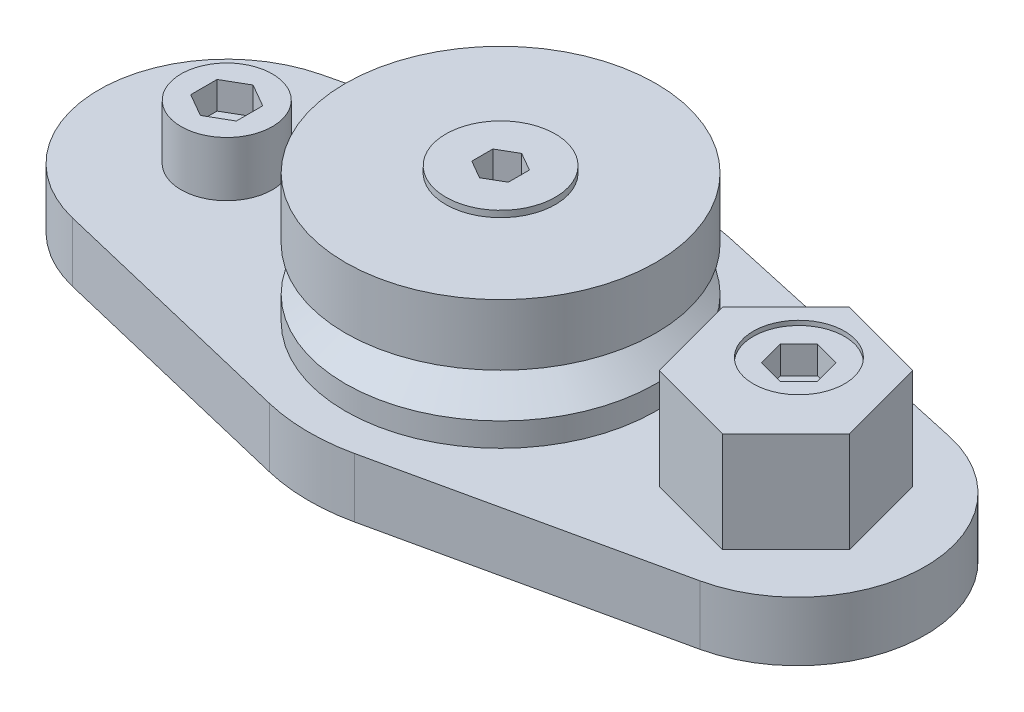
ISO-10303-21;
HEADER;
FILE_DESCRIPTION(('STEP AP214'),'2;1');
FILE_NAME('part.step','',(''),(''),'','','');
FILE_SCHEMA(('AUTOMOTIVE_DESIGN { 1 0 10303 214 1 1 1 1 }'));
ENDSEC;
DATA;
#1=APPLICATION_CONTEXT('core data for automotive mechanical design processes');
#2=APPLICATION_PROTOCOL_DEFINITION('international standard','automotive_design',2000,#1);
#3=PRODUCT_CONTEXT('',#1,'mechanical');
#4=PRODUCT('Part','Part','',(#3));
#5=PRODUCT_RELATED_PRODUCT_CATEGORY('part','',(#4));
#6=PRODUCT_DEFINITION_FORMATION('','',#4);
#7=PRODUCT_DEFINITION_CONTEXT('part definition',#1,'design');
#8=PRODUCT_DEFINITION('design','',#6,#7);
#9=PRODUCT_DEFINITION_SHAPE('','',#8);
#10=(LENGTH_UNIT() NAMED_UNIT(*) SI_UNIT(.MILLI.,.METRE.));
#11=(NAMED_UNIT(*) PLANE_ANGLE_UNIT() SI_UNIT($,.RADIAN.));
#12=(NAMED_UNIT(*) SI_UNIT($,.STERADIAN.) SOLID_ANGLE_UNIT());
#13=UNCERTAINTY_MEASURE_WITH_UNIT(LENGTH_MEASURE(1.E-05),#10,'distance_accuracy_value','');
#14=(GEOMETRIC_REPRESENTATION_CONTEXT(3) GLOBAL_UNCERTAINTY_ASSIGNED_CONTEXT((#13)) GLOBAL_UNIT_ASSIGNED_CONTEXT((#10,
#11,#12)) REPRESENTATION_CONTEXT('',''));
#15=CARTESIAN_POINT('',(0.,0.,0.));
#16=DIRECTION('',(0.,0.,1.));
#17=DIRECTION('',(1.,0.,0.));
#18=AXIS2_PLACEMENT_3D('',#15,#16,#17);
#19=CARTESIAN_POINT('',(-29.9999999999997,6.5,0.));
#20=DIRECTION('',(0.,1.,0.));
#21=DIRECTION('',(0.,0.,1.));
#22=AXIS2_PLACEMENT_3D('',#19,#20,#21);
#23=PLANE('',#22);
#24=DIRECTION('',(-0.707106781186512,0.,0.707106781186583));
#25=VECTOR('',#24,1.);
#26=CARTESIAN_POINT('',(28.719702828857,6.5,-9.4805181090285));
#27=LINE('',#26,#25);
#28=CARTESIAN_POINT('',(28.719702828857,6.5,-9.4805181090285));
#29=VERTEX_POINT('',#28);
#30=CARTESIAN_POINT('',(25.0849772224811,6.5,-5.84579250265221));
#31=VERTEX_POINT('',#30);
#32=EDGE_CURVE('E307',#29,#31,#27,.T.);
#33=ORIENTED_EDGE('',*,*,#32,.F.);
#34=DIRECTION('',(-0.965925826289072,0.,-0.258819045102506));
#35=VECTOR('',#34,1.);
#36=CARTESIAN_POINT('',(38.200220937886,6.5,-6.9402209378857));
#37=LINE('',#36,#35);
#38=CARTESIAN_POINT('',(38.200220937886,6.5,-6.9402209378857));
#39=VERTEX_POINT('',#38);
#40=EDGE_CURVE('E324',#39,#29,#37,.T.);
#41=ORIENTED_EDGE('',*,*,#40,.F.);
#42=DIRECTION('',(-0.258819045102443,0.,-0.965925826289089));
#43=VECTOR('',#42,1.);
#44=CARTESIAN_POINT('',(40.740518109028,6.5,2.5402971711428));
#45=LINE('',#44,#43);
#46=CARTESIAN_POINT('',(40.740518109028,6.5,2.5402971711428));
#47=VERTEX_POINT('',#46);
#48=EDGE_CURVE('E321',#47,#39,#45,.T.);
#49=ORIENTED_EDGE('',*,*,#48,.F.);
#50=DIRECTION('',(0.707106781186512,0.,-0.707106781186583));
#51=VECTOR('',#50,1.);
#52=CARTESIAN_POINT('',(33.800297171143,6.5,9.4805181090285));
#53=LINE('',#52,#51);
#54=CARTESIAN_POINT('',(33.800297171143,6.5,9.4805181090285));
#55=VERTEX_POINT('',#54);
#56=EDGE_CURVE('E318',#55,#47,#53,.T.);
#57=ORIENTED_EDGE('',*,*,#56,.F.);
#58=DIRECTION('',(0.965925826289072,0.,0.258819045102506));
#59=VECTOR('',#58,1.);
#60=CARTESIAN_POINT('',(24.319779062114,6.5,6.9402209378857));
#61=LINE('',#60,#59);
#62=CARTESIAN_POINT('',(24.319779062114,6.5,6.9402209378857));
#63=VERTEX_POINT('',#62);
#64=EDGE_CURVE('E315',#63,#55,#61,.T.);
#65=ORIENTED_EDGE('',*,*,#64,.F.);
#66=DIRECTION('',(0.258819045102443,0.,0.965925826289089));
#67=VECTOR('',#66,1.);
#68=CARTESIAN_POINT('',(21.779481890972,6.5,-2.5402971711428));
#69=LINE('',#68,#67);
#70=CARTESIAN_POINT('',(23.8429207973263,6.5,5.16056166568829));
#71=VERTEX_POINT('',#70);
#72=EDGE_CURVE('E310',#71,#63,#69,.T.);
#73=ORIENTED_EDGE('',*,*,#72,.F.);
#74=CARTESIAN_POINT('',(27.5,6.5,0.));
#75=DIRECTION('',(0.,1.,0.));
#76=DIRECTION('',(0.,0.,1.));
#77=AXIS2_PLACEMENT_3D('',#74,#75,#76);
#78=CIRCLE('',#77,6.325);
#79=EDGE_CURVE('E501',#31,#71,#78,.T.);
#80=ORIENTED_EDGE('',*,*,#79,.F.);
#81=EDGE_LOOP('',(#33,#41,#49,#57,#65,#73,#80));
#82=FACE_BOUND('',#81,.T.);
#83=CARTESIAN_POINT('',(-30.,6.5,0.));
#84=DIRECTION('',(0.,1.,0.));
#85=DIRECTION('',(0.,0.,1.));
#86=AXIS2_PLACEMENT_3D('',#83,#84,#85);
#87=CIRCLE('',#86,5.);
#88=CARTESIAN_POINT('',(-30.,6.5,5.));
#89=VERTEX_POINT('',#88);
#90=EDGE_CURVE('E415',#89,#89,#87,.T.);
#91=ORIENTED_EDGE('',*,*,#90,.F.);
#92=EDGE_LOOP('',(#91));
#93=FACE_BOUND('',#92,.T.);
#94=CARTESIAN_POINT('',(0.,6.5,0.));
#95=DIRECTION('',(0.,1.,0.));
#96=DIRECTION('',(0.,0.,1.));
#97=AXIS2_PLACEMENT_3D('',#94,#95,#96);
#98=CIRCLE('',#97,17.);
#99=CARTESIAN_POINT('',(0.,6.5,17.));
#100=VERTEX_POINT('',#99);
#101=EDGE_CURVE('E490',#100,#100,#98,.F.);
#102=ORIENTED_EDGE('',*,*,#101,.T.);
#103=EDGE_LOOP('',(#102));
#104=FACE_BOUND('',#103,.T.);
#105=CARTESIAN_POINT('',(-29.9999999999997,6.5,0.));
#106=DIRECTION('',(0.,1.,0.));
#107=DIRECTION('',(0.,0.,1.));
#108=AXIS2_PLACEMENT_3D('',#105,#106,#107);
#109=CIRCLE('',#108,14.0000000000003);
#110=CARTESIAN_POINT('',(-33.266666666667,6.5,-13.613555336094));
#111=VERTEX_POINT('',#110);
#112=CARTESIAN_POINT('',(-33.266666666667,6.5,13.613555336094));
#113=VERTEX_POINT('',#112);
#114=EDGE_CURVE('E532',#111,#113,#109,.T.);
#115=ORIENTED_EDGE('',*,*,#114,.T.);
#116=DIRECTION('',(0.972396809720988,0.,0.233333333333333));
#117=VECTOR('',#116,1.);
#118=CARTESIAN_POINT('',(-33.266666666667,6.5,13.613555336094));
#119=LINE('',#118,#117);
#120=CARTESIAN_POINT('',(-4.9,6.5,20.420333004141));
#121=VERTEX_POINT('',#120);
#122=EDGE_CURVE('E535',#113,#121,#119,.T.);
#123=ORIENTED_EDGE('',*,*,#122,.T.);
#124=CARTESIAN_POINT('',(-1.02695629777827E-12,6.5,-7.67441665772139E-12));
#125=DIRECTION('',(0.,1.,0.));
#126=DIRECTION('',(0.,0.,1.));
#127=AXIS2_PLACEMENT_3D('',#124,#125,#126);
#128=CIRCLE('',#127,21.0000000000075);
#129=CARTESIAN_POINT('',(4.5230769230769,6.5,20.507115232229));
#130=VERTEX_POINT('',#129);
#131=EDGE_CURVE('E538',#121,#130,#128,.T.);
#132=ORIENTED_EDGE('',*,*,#131,.T.);
#133=DIRECTION('',(0.976529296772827,0.,-0.21538461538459));
#134=VECTOR('',#133,1.);
#135=CARTESIAN_POINT('',(4.5230769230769,6.5,20.507115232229));
#136=LINE('',#135,#134);
#137=CARTESIAN_POINT('',(35.515384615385,6.5,13.67141015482));
#138=VERTEX_POINT('',#137);
#139=EDGE_CURVE('E540',#130,#138,#136,.T.);
#140=ORIENTED_EDGE('',*,*,#139,.T.);
#141=CARTESIAN_POINT('',(32.4999999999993,6.5,0.));
#142=DIRECTION('',(0.,1.,0.));
#143=DIRECTION('',(0.,0.,1.));
#144=AXIS2_PLACEMENT_3D('',#141,#142,#143);
#145=CIRCLE('',#144,14.0000000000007);
#146=CARTESIAN_POINT('',(35.515384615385,6.5,-13.67141015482));
#147=VERTEX_POINT('',#146);
#148=EDGE_CURVE('E542',#138,#147,#145,.T.);
#149=ORIENTED_EDGE('',*,*,#148,.T.);
#150=DIRECTION('',(-0.976529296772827,0.,-0.21538461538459));
#151=VECTOR('',#150,1.);
#152=CARTESIAN_POINT('',(35.515384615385,6.5,-13.67141015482));
#153=LINE('',#152,#151);
#154=CARTESIAN_POINT('',(4.52307692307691,6.5,-20.507115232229));
#155=VERTEX_POINT('',#154);
#156=EDGE_CURVE('E544',#147,#155,#153,.T.);
#157=ORIENTED_EDGE('',*,*,#156,.T.);
#158=CARTESIAN_POINT('',(-1.02695629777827E-12,6.5,-7.67441665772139E-12));
#159=DIRECTION('',(0.,1.,0.));
#160=DIRECTION('',(0.,0.,1.));
#161=AXIS2_PLACEMENT_3D('',#158,#159,#160);
#162=CIRCLE('',#161,20.9999999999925);
#163=CARTESIAN_POINT('',(-4.9,6.5,-20.420333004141));
#164=VERTEX_POINT('',#163);
#165=EDGE_CURVE('E546',#155,#164,#162,.T.);
#166=ORIENTED_EDGE('',*,*,#165,.T.);
#167=DIRECTION('',(-0.972396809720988,0.,0.233333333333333));
#168=VECTOR('',#167,1.);
#169=CARTESIAN_POINT('',(-4.9,6.5,-20.420333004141));
#170=LINE('',#169,#168);
#171=EDGE_CURVE('E548',#164,#111,#170,.T.);
#172=ORIENTED_EDGE('',*,*,#171,.T.);
#173=EDGE_LOOP('',(#115,#123,#132,#140,#149,#157,#166,#172));
#174=FACE_BOUND('',#173,.T.);
#175=ADVANCED_FACE('F37',(#82,#93,#104,#174),#23,.T.);
#176=CARTESIAN_POINT('',(-29.9999999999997,0.,0.));
#177=DIRECTION('',(0.,1.,0.));
#178=DIRECTION('',(0.,0.,1.));
#179=AXIS2_PLACEMENT_3D('',#176,#177,#178);
#180=PLANE('',#179);
#181=CARTESIAN_POINT('',(-29.9999999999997,0.,0.));
#182=DIRECTION('',(0.,1.,0.));
#183=DIRECTION('',(0.,0.,1.));
#184=AXIS2_PLACEMENT_3D('',#181,#182,#183);
#185=CIRCLE('',#184,14.0000000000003);
#186=CARTESIAN_POINT('',(-33.266666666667,0.,-13.613555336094));
#187=VERTEX_POINT('',#186);
#188=CARTESIAN_POINT('',(-33.266666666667,0.,13.613555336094));
#189=VERTEX_POINT('',#188);
#190=EDGE_CURVE('E531',#187,#189,#185,.T.);
#191=ORIENTED_EDGE('',*,*,#190,.F.);
#192=DIRECTION('',(-0.972396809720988,0.,0.233333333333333));
#193=VECTOR('',#192,1.);
#194=CARTESIAN_POINT('',(-4.9,0.,-20.420333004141));
#195=LINE('',#194,#193);
#196=CARTESIAN_POINT('',(-4.9,0.,-20.420333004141));
#197=VERTEX_POINT('',#196);
#198=EDGE_CURVE('E536',#197,#187,#195,.T.);
#199=ORIENTED_EDGE('',*,*,#198,.F.);
#200=CARTESIAN_POINT('',(-1.02695629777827E-12,0.,-7.67441665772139E-12));
#201=DIRECTION('',(0.,1.,0.));
#202=DIRECTION('',(0.,0.,1.));
#203=AXIS2_PLACEMENT_3D('',#200,#201,#202);
#204=CIRCLE('',#203,20.9999999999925);
#205=CARTESIAN_POINT('',(4.52307692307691,0.,-20.507115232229));
#206=VERTEX_POINT('',#205);
#207=EDGE_CURVE('E563',#206,#197,#204,.T.);
#208=ORIENTED_EDGE('',*,*,#207,.F.);
#209=DIRECTION('',(-0.976529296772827,0.,-0.21538461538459));
#210=VECTOR('',#209,1.);
#211=CARTESIAN_POINT('',(35.515384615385,0.,-13.67141015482));
#212=LINE('',#211,#210);
#213=CARTESIAN_POINT('',(35.515384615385,0.,-13.67141015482));
#214=VERTEX_POINT('',#213);
#215=EDGE_CURVE('E561',#214,#206,#212,.T.);
#216=ORIENTED_EDGE('',*,*,#215,.F.);
#217=CARTESIAN_POINT('',(32.4999999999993,0.,0.));
#218=DIRECTION('',(0.,1.,0.));
#219=DIRECTION('',(0.,0.,1.));
#220=AXIS2_PLACEMENT_3D('',#217,#218,#219);
#221=CIRCLE('',#220,14.0000000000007);
#222=CARTESIAN_POINT('',(35.515384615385,0.,13.67141015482));
#223=VERTEX_POINT('',#222);
#224=EDGE_CURVE('E559',#223,#214,#221,.T.);
#225=ORIENTED_EDGE('',*,*,#224,.F.);
#226=DIRECTION('',(0.976529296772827,0.,-0.21538461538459));
#227=VECTOR('',#226,1.);
#228=CARTESIAN_POINT('',(4.5230769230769,0.,20.507115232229));
#229=LINE('',#228,#227);
#230=CARTESIAN_POINT('',(4.5230769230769,0.,20.507115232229));
#231=VERTEX_POINT('',#230);
#232=EDGE_CURVE('E557',#231,#223,#229,.T.);
#233=ORIENTED_EDGE('',*,*,#232,.F.);
#234=CARTESIAN_POINT('',(-1.02695629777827E-12,0.,-7.67441665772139E-12));
#235=DIRECTION('',(0.,1.,0.));
#236=DIRECTION('',(0.,0.,1.));
#237=AXIS2_PLACEMENT_3D('',#234,#235,#236);
#238=CIRCLE('',#237,21.0000000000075);
#239=CARTESIAN_POINT('',(-4.9,0.,20.420333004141));
#240=VERTEX_POINT('',#239);
#241=EDGE_CURVE('E555',#240,#231,#238,.T.);
#242=ORIENTED_EDGE('',*,*,#241,.F.);
#243=DIRECTION('',(0.972396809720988,0.,0.233333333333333));
#244=VECTOR('',#243,1.);
#245=CARTESIAN_POINT('',(-33.266666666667,0.,13.613555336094));
#246=LINE('',#245,#244);
#247=EDGE_CURVE('E553',#189,#240,#246,.T.);
#248=ORIENTED_EDGE('',*,*,#247,.F.);
#249=EDGE_LOOP('',(#191,#199,#208,#216,#225,#233,#242,#248));
#250=FACE_BOUND('',#249,.T.);
#251=CARTESIAN_POINT('',(27.5,0.,0.));
#252=DIRECTION('',(0.,1.,0.));
#253=DIRECTION('',(0.,0.,1.));
#254=AXIS2_PLACEMENT_3D('',#251,#252,#253);
#255=CIRCLE('',#254,6.325);
#256=CARTESIAN_POINT('',(27.5,0.,-6.325));
#257=VERTEX_POINT('',#256);
#258=CARTESIAN_POINT('',(27.5,0.,6.325));
#259=VERTEX_POINT('',#258);
#260=EDGE_CURVE('E496',#257,#259,#255,.T.);
#261=ORIENTED_EDGE('',*,*,#260,.T.);
#262=DIRECTION('',(1.,0.,0.));
#263=VECTOR('',#262,1.);
#264=CARTESIAN_POINT('',(27.5,0.,6.325));
#265=LINE('',#264,#263);
#266=CARTESIAN_POINT('',(32.5,0.,6.325));
#267=VERTEX_POINT('',#266);
#268=EDGE_CURVE('E513',#259,#267,#265,.T.);
#269=ORIENTED_EDGE('',*,*,#268,.T.);
#270=CARTESIAN_POINT('',(32.4999999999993,0.,0.));
#271=DIRECTION('',(0.,1.,0.));
#272=DIRECTION('',(0.,0.,1.));
#273=AXIS2_PLACEMENT_3D('',#270,#271,#272);
#274=CIRCLE('',#273,6.325);
#275=CARTESIAN_POINT('',(32.5,0.,-6.325));
#276=VERTEX_POINT('',#275);
#277=EDGE_CURVE('E516',#267,#276,#274,.T.);
#278=ORIENTED_EDGE('',*,*,#277,.T.);
#279=DIRECTION('',(-1.,0.,0.));
#280=VECTOR('',#279,1.);
#281=CARTESIAN_POINT('',(32.5,0.,-6.325));
#282=LINE('',#281,#280);
#283=EDGE_CURVE('E519',#276,#257,#282,.T.);
#284=ORIENTED_EDGE('',*,*,#283,.T.);
#285=EDGE_LOOP('',(#261,#269,#278,#284));
#286=FACE_BOUND('',#285,.T.);
#287=CARTESIAN_POINT('',(-29.9999999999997,0.,0.));
#288=DIRECTION('',(0.,1.,0.));
#289=DIRECTION('',(0.,0.,1.));
#290=AXIS2_PLACEMENT_3D('',#287,#288,#289);
#291=CIRCLE('',#290,3.29999999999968);
#292=CARTESIAN_POINT('',(-29.9999999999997,0.,-3.29999999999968));
#293=VERTEX_POINT('',#292);
#294=EDGE_CURVE('E493',#293,#293,#291,.T.);
#295=ORIENTED_EDGE('',*,*,#294,.T.);
#296=EDGE_LOOP('',(#295));
#297=FACE_BOUND('',#296,.T.);
#298=ADVANCED_FACE('F627',(#250,#286,#297),#180,.F.);
#299=CARTESIAN_POINT('',(-29.9999999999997,6.5,0.));
#300=DIRECTION('',(0.,-1.,0.));
#301=DIRECTION('',(0.,0.,-1.));
#302=AXIS2_PLACEMENT_3D('',#299,#300,#301);
#303=CYLINDRICAL_SURFACE('',#302,14.0000000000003);
#304=ORIENTED_EDGE('',*,*,#190,.T.);
#305=DIRECTION('',(0.,-1.,0.));
#306=VECTOR('',#305,1.);
#307=CARTESIAN_POINT('',(-33.266666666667,6.5,13.613555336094));
#308=LINE('',#307,#306);
#309=EDGE_CURVE('E281',#113,#189,#308,.T.);
#310=ORIENTED_EDGE('',*,*,#309,.F.);
#311=ORIENTED_EDGE('',*,*,#114,.F.);
#312=DIRECTION('',(0.,-1.,0.));
#313=VECTOR('',#312,1.);
#314=CARTESIAN_POINT('',(-33.266666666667,6.5,-13.613555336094));
#315=LINE('',#314,#313);
#316=EDGE_CURVE('E550',#111,#187,#315,.T.);
#317=ORIENTED_EDGE('',*,*,#316,.T.);
#318=EDGE_LOOP('',(#304,#310,#311,#317));
#319=FACE_BOUND('',#318,.T.);
#320=ADVANCED_FACE('F39',(#319),#303,.T.);
#321=CARTESIAN_POINT('',(-33.266666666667,6.5,13.613555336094));
#322=DIRECTION('',(0.233333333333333,0.,-0.972396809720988));
#323=DIRECTION('',(-0.972396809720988,0.,-0.233333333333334));
#324=AXIS2_PLACEMENT_3D('',#321,#322,#323);
#325=PLANE('',#324);
#326=ORIENTED_EDGE('',*,*,#247,.T.);
#327=DIRECTION('',(0.,-1.,0.));
#328=VECTOR('',#327,1.);
#329=CARTESIAN_POINT('',(-4.9,6.5,20.420333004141));
#330=LINE('',#329,#328);
#331=EDGE_CURVE('E583',#121,#240,#330,.T.);
#332=ORIENTED_EDGE('',*,*,#331,.F.);
#333=ORIENTED_EDGE('',*,*,#122,.F.);
#334=ORIENTED_EDGE('',*,*,#309,.T.);
#335=EDGE_LOOP('',(#326,#332,#333,#334));
#336=FACE_BOUND('',#335,.T.);
#337=ADVANCED_FACE('F676',(#336),#325,.F.);
#338=CARTESIAN_POINT('',(-1.02695629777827E-12,6.5,-7.67441665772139E-12));
#339=DIRECTION('',(0.,-1.,0.));
#340=DIRECTION('',(0.,0.,-1.));
#341=AXIS2_PLACEMENT_3D('',#338,#339,#340);
#342=CYLINDRICAL_SURFACE('',#341,21.0000000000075);
#343=ORIENTED_EDGE('',*,*,#241,.T.);
#344=DIRECTION('',(0.,-1.,0.));
#345=VECTOR('',#344,1.);
#346=CARTESIAN_POINT('',(4.5230769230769,6.5,20.507115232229));
#347=LINE('',#346,#345);
#348=EDGE_CURVE('E580',#130,#231,#347,.T.);
#349=ORIENTED_EDGE('',*,*,#348,.F.);
#350=ORIENTED_EDGE('',*,*,#131,.F.);
#351=ORIENTED_EDGE('',*,*,#331,.T.);
#352=EDGE_LOOP('',(#343,#349,#350,#351));
#353=FACE_BOUND('',#352,.T.);
#354=ADVANCED_FACE('F673',(#353),#342,.T.);
#355=CARTESIAN_POINT('',(4.5230769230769,6.5,20.507115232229));
#356=DIRECTION('',(-0.21538461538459,0.,-0.976529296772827));
#357=DIRECTION('',(-0.976529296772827,0.,0.21538461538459));
#358=AXIS2_PLACEMENT_3D('',#355,#356,#357);
#359=PLANE('',#358);
#360=ORIENTED_EDGE('',*,*,#232,.T.);
#361=DIRECTION('',(0.,-1.,0.));
#362=VECTOR('',#361,1.);
#363=CARTESIAN_POINT('',(35.515384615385,6.5,13.67141015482));
#364=LINE('',#363,#362);
#365=EDGE_CURVE('E577',#138,#223,#364,.T.);
#366=ORIENTED_EDGE('',*,*,#365,.F.);
#367=ORIENTED_EDGE('',*,*,#139,.F.);
#368=ORIENTED_EDGE('',*,*,#348,.T.);
#369=EDGE_LOOP('',(#360,#366,#367,#368));
#370=FACE_BOUND('',#369,.T.);
#371=ADVANCED_FACE('F669',(#370),#359,.F.);
#372=CARTESIAN_POINT('',(32.4999999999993,6.5,0.));
#373=DIRECTION('',(0.,-1.,0.));
#374=DIRECTION('',(0.,0.,-1.));
#375=AXIS2_PLACEMENT_3D('',#372,#373,#374);
#376=CYLINDRICAL_SURFACE('',#375,14.0000000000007);
#377=ORIENTED_EDGE('',*,*,#224,.T.);
#378=DIRECTION('',(0.,-1.,0.));
#379=VECTOR('',#378,1.);
#380=CARTESIAN_POINT('',(35.515384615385,6.5,-13.67141015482));
#381=LINE('',#380,#379);
#382=EDGE_CURVE('E574',#147,#214,#381,.T.);
#383=ORIENTED_EDGE('',*,*,#382,.F.);
#384=ORIENTED_EDGE('',*,*,#148,.F.);
#385=ORIENTED_EDGE('',*,*,#365,.T.);
#386=EDGE_LOOP('',(#377,#383,#384,#385));
#387=FACE_BOUND('',#386,.T.);
#388=ADVANCED_FACE('F665',(#387),#376,.T.);
#389=CARTESIAN_POINT('',(35.515384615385,6.5,-13.67141015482));
#390=DIRECTION('',(-0.21538461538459,0.,0.976529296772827));
#391=DIRECTION('',(0.976529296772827,0.,0.21538461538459));
#392=AXIS2_PLACEMENT_3D('',#389,#390,#391);
#393=PLANE('',#392);
#394=ORIENTED_EDGE('',*,*,#215,.T.);
#395=DIRECTION('',(0.,-1.,0.));
#396=VECTOR('',#395,1.);
#397=CARTESIAN_POINT('',(4.52307692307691,6.5,-20.507115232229));
#398=LINE('',#397,#396);
#399=EDGE_CURVE('E571',#155,#206,#398,.T.);
#400=ORIENTED_EDGE('',*,*,#399,.F.);
#401=ORIENTED_EDGE('',*,*,#156,.F.);
#402=ORIENTED_EDGE('',*,*,#382,.T.);
#403=EDGE_LOOP('',(#394,#400,#401,#402));
#404=FACE_BOUND('',#403,.T.);
#405=ADVANCED_FACE('F661',(#404),#393,.F.);
#406=CARTESIAN_POINT('',(-1.02695629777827E-12,6.5,-7.67441665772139E-12));
#407=DIRECTION('',(0.,-1.,0.));
#408=DIRECTION('',(0.,0.,-1.));
#409=AXIS2_PLACEMENT_3D('',#406,#407,#408);
#410=CYLINDRICAL_SURFACE('',#409,20.9999999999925);
#411=ORIENTED_EDGE('',*,*,#207,.T.);
#412=DIRECTION('',(0.,-1.,0.));
#413=VECTOR('',#412,1.);
#414=CARTESIAN_POINT('',(-4.9,6.5,-20.420333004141));
#415=LINE('',#414,#413);
#416=EDGE_CURVE('E568',#164,#197,#415,.T.);
#417=ORIENTED_EDGE('',*,*,#416,.F.);
#418=ORIENTED_EDGE('',*,*,#165,.F.);
#419=ORIENTED_EDGE('',*,*,#399,.T.);
#420=EDGE_LOOP('',(#411,#417,#418,#419));
#421=FACE_BOUND('',#420,.T.);
#422=ADVANCED_FACE('F657',(#421),#410,.T.);
#423=CARTESIAN_POINT('',(-4.9,6.5,-20.420333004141));
#424=DIRECTION('',(0.233333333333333,0.,0.972396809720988));
#425=DIRECTION('',(0.972396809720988,0.,-0.233333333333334));
#426=AXIS2_PLACEMENT_3D('',#423,#424,#425);
#427=PLANE('',#426);
#428=ORIENTED_EDGE('',*,*,#198,.T.);
#429=ORIENTED_EDGE('',*,*,#316,.F.);
#430=ORIENTED_EDGE('',*,*,#171,.F.);
#431=ORIENTED_EDGE('',*,*,#416,.T.);
#432=EDGE_LOOP('',(#428,#429,#430,#431));
#433=FACE_BOUND('',#432,.T.);
#434=ADVANCED_FACE('F654',(#433),#427,.F.);
#435=CARTESIAN_POINT('',(27.5,6.5,0.));
#436=DIRECTION('',(0.,-1.,0.));
#437=DIRECTION('',(0.,0.,-1.));
#438=AXIS2_PLACEMENT_3D('',#435,#436,#437);
#439=CYLINDRICAL_SURFACE('',#438,6.325);
#440=ORIENTED_EDGE('',*,*,#260,.F.);
#441=DIRECTION('',(0.,-1.,0.));
#442=VECTOR('',#441,1.);
#443=CARTESIAN_POINT('',(27.5,6.5,-6.325));
#444=LINE('',#443,#442);
#445=CARTESIAN_POINT('',(27.5,6.5,-6.325));
#446=VERTEX_POINT('',#445);
#447=EDGE_CURVE('E510',#446,#257,#444,.T.);
#448=ORIENTED_EDGE('',*,*,#447,.F.);
#449=EDGE_CURVE('E497',#446,#31,#78,.T.);
#450=ORIENTED_EDGE('',*,*,#449,.T.);
#451=ORIENTED_EDGE('',*,*,#79,.T.);
#452=CARTESIAN_POINT('',(27.5,6.5,0.));
#453=DIRECTION('',(0.,1.,0.));
#454=DIRECTION('',(0.,0.,1.));
#455=AXIS2_PLACEMENT_3D('',#452,#453,#454);
#456=CIRCLE('',#455,6.325);
#457=CARTESIAN_POINT('',(27.5,6.5,6.325));
#458=VERTEX_POINT('',#457);
#459=EDGE_CURVE('E348',#71,#458,#456,.T.);
#460=ORIENTED_EDGE('',*,*,#459,.T.);
#461=DIRECTION('',(0.,-1.,0.));
#462=VECTOR('',#461,1.);
#463=CARTESIAN_POINT('',(27.5,6.5,6.325));
#464=LINE('',#463,#462);
#465=EDGE_CURVE('E528',#458,#259,#464,.T.);
#466=ORIENTED_EDGE('',*,*,#465,.T.);
#467=EDGE_LOOP('',(#440,#448,#450,#451,#460,#466));
#468=FACE_BOUND('',#467,.T.);
#469=ADVANCED_FACE('F614',(#468),#439,.F.);
#470=CARTESIAN_POINT('',(27.5,6.5,6.325));
#471=DIRECTION('',(0.,0.,-1.));
#472=DIRECTION('',(-1.,0.,0.));
#473=AXIS2_PLACEMENT_3D('',#470,#471,#472);
#474=PLANE('',#473);
#475=ORIENTED_EDGE('',*,*,#268,.F.);
#476=ORIENTED_EDGE('',*,*,#465,.F.);
#477=DIRECTION('',(1.,0.,0.));
#478=VECTOR('',#477,1.);
#479=CARTESIAN_POINT('',(27.5,6.5,6.325));
#480=LINE('',#479,#478);
#481=CARTESIAN_POINT('',(32.4999999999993,6.5,6.325));
#482=VERTEX_POINT('',#481);
#483=EDGE_CURVE('E500',#458,#482,#480,.T.);
#484=ORIENTED_EDGE('',*,*,#483,.T.);
#485=DIRECTION('',(0.,-1.,0.));
#486=VECTOR('',#485,1.);
#487=CARTESIAN_POINT('',(32.5,6.5,6.325));
#488=LINE('',#487,#486);
#489=EDGE_CURVE('E526',#482,#267,#488,.T.);
#490=ORIENTED_EDGE('',*,*,#489,.T.);
#491=EDGE_LOOP('',(#475,#476,#484,#490));
#492=FACE_BOUND('',#491,.T.);
#493=ADVANCED_FACE('F625',(#492),#474,.T.);
#494=CARTESIAN_POINT('',(32.4999999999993,6.5,0.));
#495=DIRECTION('',(0.,-1.,0.));
#496=DIRECTION('',(0.,0.,-1.));
#497=AXIS2_PLACEMENT_3D('',#494,#495,#496);
#498=CYLINDRICAL_SURFACE('',#497,6.325);
#499=ORIENTED_EDGE('',*,*,#277,.F.);
#500=ORIENTED_EDGE('',*,*,#489,.F.);
#501=CARTESIAN_POINT('',(32.4999999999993,6.5,0.));
#502=DIRECTION('',(0.,1.,0.));
#503=DIRECTION('',(0.,0.,1.));
#504=AXIS2_PLACEMENT_3D('',#501,#502,#503);
#505=CIRCLE('',#504,6.325);
#506=CARTESIAN_POINT('',(32.5,6.5,-6.325));
#507=VERTEX_POINT('',#506);
#508=EDGE_CURVE('E504',#482,#507,#505,.T.);
#509=ORIENTED_EDGE('',*,*,#508,.T.);
#510=DIRECTION('',(0.,-1.,0.));
#511=VECTOR('',#510,1.);
#512=CARTESIAN_POINT('',(32.5,6.5,-6.325));
#513=LINE('',#512,#511);
#514=EDGE_CURVE('E524',#507,#276,#513,.T.);
#515=ORIENTED_EDGE('',*,*,#514,.T.);
#516=EDGE_LOOP('',(#499,#500,#509,#515));
#517=FACE_BOUND('',#516,.T.);
#518=ADVANCED_FACE('F623',(#517),#498,.F.);
#519=CARTESIAN_POINT('',(32.5,6.5,-6.325));
#520=DIRECTION('',(0.,0.,1.));
#521=DIRECTION('',(1.,0.,0.));
#522=AXIS2_PLACEMENT_3D('',#519,#520,#521);
#523=PLANE('',#522);
#524=ORIENTED_EDGE('',*,*,#283,.F.);
#525=ORIENTED_EDGE('',*,*,#514,.F.);
#526=DIRECTION('',(-1.,0.,0.));
#527=VECTOR('',#526,1.);
#528=CARTESIAN_POINT('',(32.5,6.5,-6.325));
#529=LINE('',#528,#527);
#530=EDGE_CURVE('E507',#507,#446,#529,.T.);
#531=ORIENTED_EDGE('',*,*,#530,.T.);
#532=ORIENTED_EDGE('',*,*,#447,.T.);
#533=EDGE_LOOP('',(#524,#525,#531,#532));
#534=FACE_BOUND('',#533,.T.);
#535=ADVANCED_FACE('F619',(#534),#523,.T.);
#536=CARTESIAN_POINT('',(-29.9999999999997,6.5,0.));
#537=DIRECTION('',(0.,-1.,0.));
#538=DIRECTION('',(0.,0.,-1.));
#539=AXIS2_PLACEMENT_3D('',#536,#537,#538);
#540=CYLINDRICAL_SURFACE('',#539,3.29999999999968);
#541=CARTESIAN_POINT('',(-29.9999999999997,6.5,0.));
#542=DIRECTION('',(0.,1.,0.));
#543=DIRECTION('',(0.,0.,1.));
#544=AXIS2_PLACEMENT_3D('',#541,#542,#543);
#545=CIRCLE('',#544,3.29999999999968);
#546=CARTESIAN_POINT('',(-29.9999999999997,6.5,-3.29999999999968));
#547=VERTEX_POINT('',#546);
#548=EDGE_CURVE('E421',#547,#547,#545,.T.);
#549=CARTESIAN_POINT('',(-29.9999999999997,6.5,-3.29999999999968));
#550=CARTESIAN_POINT('',(-29.9999999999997,6.43229166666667,-3.29999999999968));
#551=CARTESIAN_POINT('',(-29.9999999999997,6.36458333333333,-3.29999999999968));
#552=CARTESIAN_POINT('',(-29.9999999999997,6.22916666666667,-3.29999999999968));
#553=CARTESIAN_POINT('',(-29.9999999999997,6.16145833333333,-3.29999999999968));
#554=CARTESIAN_POINT('',(-29.9999999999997,6.02604166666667,-3.29999999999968));
#555=CARTESIAN_POINT('',(-29.9999999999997,5.95833333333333,-3.29999999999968));
#556=CARTESIAN_POINT('',(-29.9999999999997,5.82291666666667,-3.29999999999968));
#557=CARTESIAN_POINT('',(-29.9999999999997,5.75520833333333,-3.29999999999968));
#558=CARTESIAN_POINT('',(-29.9999999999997,5.61979166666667,-3.29999999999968));
#559=CARTESIAN_POINT('',(-29.9999999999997,5.55208333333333,-3.29999999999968));
#560=CARTESIAN_POINT('',(-29.9999999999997,5.41666666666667,-3.29999999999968));
#561=CARTESIAN_POINT('',(-29.9999999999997,5.34895833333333,-3.29999999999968));
#562=CARTESIAN_POINT('',(-29.9999999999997,5.21354166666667,-3.29999999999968));
#563=CARTESIAN_POINT('',(-29.9999999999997,5.14583333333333,-3.29999999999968));
#564=CARTESIAN_POINT('',(-29.9999999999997,5.01041666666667,-3.29999999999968));
#565=CARTESIAN_POINT('',(-29.9999999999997,4.94270833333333,-3.29999999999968));
#566=CARTESIAN_POINT('',(-29.9999999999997,4.80729166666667,-3.29999999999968));
#567=CARTESIAN_POINT('',(-29.9999999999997,4.73958333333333,-3.29999999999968));
#568=CARTESIAN_POINT('',(-29.9999999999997,4.60416666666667,-3.29999999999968));
#569=CARTESIAN_POINT('',(-29.9999999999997,4.53645833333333,-3.29999999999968));
#570=CARTESIAN_POINT('',(-29.9999999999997,4.40104166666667,-3.29999999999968));
#571=CARTESIAN_POINT('',(-29.9999999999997,4.33333333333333,-3.29999999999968));
#572=CARTESIAN_POINT('',(-29.9999999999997,4.19791666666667,-3.29999999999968));
#573=CARTESIAN_POINT('',(-29.9999999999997,4.13020833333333,-3.29999999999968));
#574=CARTESIAN_POINT('',(-29.9999999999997,3.99479166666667,-3.29999999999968));
#575=CARTESIAN_POINT('',(-29.9999999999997,3.92708333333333,-3.29999999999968));
#576=CARTESIAN_POINT('',(-29.9999999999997,3.79166666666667,-3.29999999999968));
#577=CARTESIAN_POINT('',(-29.9999999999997,3.72395833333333,-3.29999999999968));
#578=CARTESIAN_POINT('',(-29.9999999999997,3.58854166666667,-3.29999999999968));
#579=CARTESIAN_POINT('',(-29.9999999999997,3.52083333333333,-3.29999999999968));
#580=CARTESIAN_POINT('',(-29.9999999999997,3.38541666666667,-3.29999999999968));
#581=CARTESIAN_POINT('',(-29.9999999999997,3.31770833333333,-3.29999999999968));
#582=CARTESIAN_POINT('',(-29.9999999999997,3.18229166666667,-3.29999999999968));
#583=CARTESIAN_POINT('',(-29.9999999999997,3.11458333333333,-3.29999999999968));
#584=CARTESIAN_POINT('',(-29.9999999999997,2.97916666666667,-3.29999999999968));
#585=CARTESIAN_POINT('',(-29.9999999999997,2.91145833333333,-3.29999999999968));
#586=CARTESIAN_POINT('',(-29.9999999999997,2.77604166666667,-3.29999999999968));
#587=CARTESIAN_POINT('',(-29.9999999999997,2.70833333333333,-3.29999999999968));
#588=CARTESIAN_POINT('',(-29.9999999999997,2.57291666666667,-3.29999999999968));
#589=CARTESIAN_POINT('',(-29.9999999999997,2.50520833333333,-3.29999999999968));
#590=CARTESIAN_POINT('',(-29.9999999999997,2.36979166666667,-3.29999999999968));
#591=CARTESIAN_POINT('',(-29.9999999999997,2.30208333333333,-3.29999999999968));
#592=CARTESIAN_POINT('',(-29.9999999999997,2.16666666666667,-3.29999999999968));
#593=CARTESIAN_POINT('',(-29.9999999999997,2.09895833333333,-3.29999999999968));
#594=CARTESIAN_POINT('',(-29.9999999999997,1.96354166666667,-3.29999999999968));
#595=CARTESIAN_POINT('',(-29.9999999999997,1.89583333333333,-3.29999999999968));
#596=CARTESIAN_POINT('',(-29.9999999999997,1.76041666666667,-3.29999999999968));
#597=CARTESIAN_POINT('',(-29.9999999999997,1.69270833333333,-3.29999999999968));
#598=CARTESIAN_POINT('',(-29.9999999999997,1.55729166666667,-3.29999999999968));
#599=CARTESIAN_POINT('',(-29.9999999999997,1.48958333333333,-3.29999999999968));
#600=CARTESIAN_POINT('',(-29.9999999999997,1.35416666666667,-3.29999999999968));
#601=CARTESIAN_POINT('',(-29.9999999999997,1.28645833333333,-3.29999999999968));
#602=CARTESIAN_POINT('',(-29.9999999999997,1.15104166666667,-3.29999999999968));
#603=CARTESIAN_POINT('',(-29.9999999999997,1.08333333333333,-3.29999999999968));
#604=CARTESIAN_POINT('',(-29.9999999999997,0.947916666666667,-3.29999999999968));
#605=CARTESIAN_POINT('',(-29.9999999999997,0.880208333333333,-3.29999999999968));
#606=CARTESIAN_POINT('',(-29.9999999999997,0.744791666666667,-3.29999999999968));
#607=CARTESIAN_POINT('',(-29.9999999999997,0.677083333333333,-3.29999999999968));
#608=CARTESIAN_POINT('',(-29.9999999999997,0.541666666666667,-3.29999999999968));
#609=CARTESIAN_POINT('',(-29.9999999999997,0.473958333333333,-3.29999999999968));
#610=CARTESIAN_POINT('',(-29.9999999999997,0.338541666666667,-3.29999999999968));
#611=CARTESIAN_POINT('',(-29.9999999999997,0.270833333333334,-3.29999999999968));
#612=CARTESIAN_POINT('',(-29.9999999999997,0.135416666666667,-3.29999999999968));
#613=CARTESIAN_POINT('',(-29.9999999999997,0.0677083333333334,-3.29999999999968));
#614=CARTESIAN_POINT('',(-29.9999999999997,0.,-3.29999999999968));
#615=B_SPLINE_CURVE_WITH_KNOTS('',3,(#549,#550,#551,#552,#553,#554,#555,#556,#557,#558,#559,
#560,#561,#562,#563,#564,#565,#566,#567,#568,#569,#570,#571,#572,#573,#574,#575,#576,#577,#578,
#579,#580,#581,#582,#583,#584,#585,#586,#587,#588,#589,#590,#591,#592,#593,#594,#595,#596,#597,
#598,#599,#600,#601,#602,#603,#604,#605,#606,#607,#608,#609,#610,#611,#612,#613,#614),
.UNSPECIFIED.,.F.,.F.,(4,2,2,2,2,2,2,2,2,2,2,2,2,2,2,2,2,2,2,2,2,2,2,2,2,2,2,2,2,2,2,2,4),(0.,
0.203125,0.40625,0.609375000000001,0.812500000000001,1.015625,1.21875,1.421875,1.625,1.828125,
2.03125,2.234375,2.4375,2.640625,2.84375,3.046875,3.25,3.453125,3.65625,3.859375,4.0625,
4.265625,4.46875,4.671875,4.875,5.078125,5.28125,5.484375,5.6875,5.890625,6.09375,6.296875,6.5),.UNSPECIFIED.);
#616=EDGE_CURVE('BSEAM634',#547,#293,#615,.T.);
#617=ORIENTED_EDGE('',*,*,#548,.T.);
#618=ORIENTED_EDGE('',*,*,#294,.F.);
#619=ORIENTED_EDGE('',*,*,#616,.T.);
#620=ORIENTED_EDGE('',*,*,#616,.F.);
#621=EDGE_LOOP('',(#617,#619,#618,#620));
#622=FACE_BOUND('',#621,.T.);
#623=ADVANCED_FACE('F634',(#622),#540,.F.);
#624=CARTESIAN_POINT('',(0.,21.3,0.));
#625=DIRECTION('',(0.,-1.,0.));
#626=DIRECTION('',(0.,0.,-1.));
#627=AXIS2_PLACEMENT_3D('',#624,#625,#626);
#628=PLANE('',#627);
#629=DIRECTION('',(0.866025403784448,0.,0.499999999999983));
#630=VECTOR('',#629,1.);
#631=CARTESIAN_POINT('',(-2.,21.3,1.1547005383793));
#632=LINE('',#631,#630);
#633=CARTESIAN_POINT('',(-2.,21.3,1.1547005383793));
#634=VERTEX_POINT('',#633);
#635=CARTESIAN_POINT('',(0.,21.3,2.3094010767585));
#636=VERTEX_POINT('',#635);
#637=EDGE_CURVE('E446',#634,#636,#632,.T.);
#638=ORIENTED_EDGE('',*,*,#637,.F.);
#639=DIRECTION('',(0.,0.,1.));
#640=VECTOR('',#639,1.);
#641=CARTESIAN_POINT('',(-2.,21.3,-1.1547005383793));
#642=LINE('',#641,#640);
#643=CARTESIAN_POINT('',(-2.,21.3,-1.1547005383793));
#644=VERTEX_POINT('',#643);
#645=EDGE_CURVE('E424',#644,#634,#642,.T.);
#646=ORIENTED_EDGE('',*,*,#645,.F.);
#647=DIRECTION('',(-0.866025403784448,0.,0.499999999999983));
#648=VECTOR('',#647,1.);
#649=CARTESIAN_POINT('',(0.,21.3,-2.3094010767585));
#650=LINE('',#649,#648);
#651=CARTESIAN_POINT('',(0.,21.3,-2.3094010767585));
#652=VERTEX_POINT('',#651);
#653=EDGE_CURVE('E429',#652,#644,#650,.T.);
#654=ORIENTED_EDGE('',*,*,#653,.F.);
#655=DIRECTION('',(-0.866025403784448,0.,-0.499999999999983));
#656=VECTOR('',#655,1.);
#657=CARTESIAN_POINT('',(2.,21.3,-1.1547005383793));
#658=LINE('',#657,#656);
#659=CARTESIAN_POINT('',(2.,21.3,-1.1547005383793));
#660=VERTEX_POINT('',#659);
#661=EDGE_CURVE('E455',#660,#652,#658,.T.);
#662=ORIENTED_EDGE('',*,*,#661,.F.);
#663=DIRECTION('',(0.,0.,-1.));
#664=VECTOR('',#663,1.);
#665=CARTESIAN_POINT('',(2.,21.3,1.1547005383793));
#666=LINE('',#665,#664);
#667=CARTESIAN_POINT('',(2.,21.3,1.1547005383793));
#668=VERTEX_POINT('',#667);
#669=EDGE_CURVE('E452',#668,#660,#666,.T.);
#670=ORIENTED_EDGE('',*,*,#669,.F.);
#671=DIRECTION('',(0.866025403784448,0.,-0.499999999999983));
#672=VECTOR('',#671,1.);
#673=CARTESIAN_POINT('',(0.,21.3,2.3094010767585));
#674=LINE('',#673,#672);
#675=EDGE_CURVE('E449',#636,#668,#674,.T.);
#676=ORIENTED_EDGE('',*,*,#675,.F.);
#677=EDGE_LOOP('',(#638,#646,#654,#662,#670,#676));
#678=FACE_BOUND('',#677,.T.);
#679=CARTESIAN_POINT('',(0.,21.3,0.));
#680=DIRECTION('',(0.,1.,0.));
#681=DIRECTION('',(0.,0.,1.));
#682=AXIS2_PLACEMENT_3D('',#679,#680,#681);
#683=CIRCLE('',#682,6.);
#684=CARTESIAN_POINT('',(0.,21.3,6.));
#685=VERTEX_POINT('',#684);
#686=EDGE_CURVE('E487',#685,#685,#683,.T.);
#687=ORIENTED_EDGE('',*,*,#686,.T.);
#688=EDGE_LOOP('',(#687));
#689=FACE_BOUND('',#688,.T.);
#690=ADVANCED_FACE('F636',(#678,#689),#628,.F.);
#691=CARTESIAN_POINT('',(0.,0.,0.));
#692=DIRECTION('',(0.,1.,0.));
#693=DIRECTION('',(0.,0.,1.));
#694=AXIS2_PLACEMENT_3D('',#691,#692,#693);
#695=CYLINDRICAL_SURFACE('',#694,6.);
#696=ORIENTED_EDGE('',*,*,#686,.F.);
#697=EDGE_LOOP('',(#696));
#698=FACE_BOUND('',#697,.T.);
#699=CARTESIAN_POINT('',(0.,20.6,0.));
#700=DIRECTION('',(0.,1.,0.));
#701=DIRECTION('',(0.,0.,1.));
#702=AXIS2_PLACEMENT_3D('',#699,#700,#701);
#703=CIRCLE('',#702,6.);
#704=CARTESIAN_POINT('',(0.,20.6,6.));
#705=VERTEX_POINT('',#704);
#706=EDGE_CURVE('E484',#705,#705,#703,.T.);
#707=ORIENTED_EDGE('',*,*,#706,.T.);
#708=EDGE_LOOP('',(#707));
#709=FACE_BOUND('',#708,.T.);
#710=ADVANCED_FACE('F643',(#698,#709),#695,.T.);
#711=CARTESIAN_POINT('',(6.,20.6,0.));
#712=DIRECTION('',(0.,-1.,0.));
#713=DIRECTION('',(0.,0.,-1.));
#714=AXIS2_PLACEMENT_3D('',#711,#712,#713);
#715=PLANE('',#714);
#716=ORIENTED_EDGE('',*,*,#706,.F.);
#717=EDGE_LOOP('',(#716));
#718=FACE_BOUND('',#717,.T.);
#719=CARTESIAN_POINT('',(0.,20.6,0.));
#720=DIRECTION('',(0.,1.,0.));
#721=DIRECTION('',(0.,0.,1.));
#722=AXIS2_PLACEMENT_3D('',#719,#720,#721);
#723=CIRCLE('',#722,17.);
#724=CARTESIAN_POINT('',(0.,20.6,17.));
#725=VERTEX_POINT('',#724);
#726=EDGE_CURVE('E481',#725,#725,#723,.T.);
#727=ORIENTED_EDGE('',*,*,#726,.T.);
#728=EDGE_LOOP('',(#727));
#729=FACE_BOUND('',#728,.T.);
#730=ADVANCED_FACE('F726',(#718,#729),#715,.F.);
#731=CARTESIAN_POINT('',(0.,0.,0.));
#732=DIRECTION('',(0.,1.,0.));
#733=DIRECTION('',(0.,0.,1.));
#734=AXIS2_PLACEMENT_3D('',#731,#732,#733);
#735=CYLINDRICAL_SURFACE('',#734,17.);
#736=ORIENTED_EDGE('',*,*,#726,.F.);
#737=EDGE_LOOP('',(#736));
#738=FACE_BOUND('',#737,.T.);
#739=CARTESIAN_POINT('',(0.,13.90521289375,0.));
#740=DIRECTION('',(0.,1.,0.));
#741=DIRECTION('',(0.,0.,1.));
#742=AXIS2_PLACEMENT_3D('',#739,#740,#741);
#743=CIRCLE('',#742,17.);
#744=CARTESIAN_POINT('',(0.,13.90521289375,17.));
#745=VERTEX_POINT('',#744);
#746=EDGE_CURVE('E478',#745,#745,#743,.T.);
#747=ORIENTED_EDGE('',*,*,#746,.T.);
#748=EDGE_LOOP('',(#747));
#749=FACE_BOUND('',#748,.T.);
#750=ADVANCED_FACE('F737',(#738,#749),#735,.T.);
#751=CARTESIAN_POINT('',(0.,11.5,0.));
#752=DIRECTION('',(0.,1.,0.));
#753=DIRECTION('',(0.,0.,1.));
#754=AXIS2_PLACEMENT_3D('',#751,#752,#753);
#755=CONICAL_SURFACE('',#754,13.565,0.95993108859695);
#756=ORIENTED_EDGE('',*,*,#746,.F.);
#757=EDGE_LOOP('',(#756));
#758=FACE_BOUND('',#757,.T.);
#759=CARTESIAN_POINT('',(0.,11.5,0.));
#760=DIRECTION('',(0.,1.,0.));
#761=DIRECTION('',(0.,0.,1.));
#762=AXIS2_PLACEMENT_3D('',#759,#760,#761);
#763=CIRCLE('',#762,13.565);
#764=CARTESIAN_POINT('',(0.,11.5,13.565));
#765=VERTEX_POINT('',#764);
#766=EDGE_CURVE('E475',#765,#765,#763,.T.);
#767=ORIENTED_EDGE('',*,*,#766,.T.);
#768=EDGE_LOOP('',(#767));
#769=FACE_BOUND('',#768,.T.);
#770=ADVANCED_FACE('F747',(#758,#769),#755,.T.);
#771=CARTESIAN_POINT('',(0.,9.0947871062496,0.));
#772=DIRECTION('',(0.,-1.,0.));
#773=DIRECTION('',(0.,0.,-1.));
#774=AXIS2_PLACEMENT_3D('',#771,#772,#773);
#775=CONICAL_SURFACE('',#774,17.,0.959931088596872);
#776=ORIENTED_EDGE('',*,*,#766,.F.);
#777=EDGE_LOOP('',(#776));
#778=FACE_BOUND('',#777,.T.);
#779=CARTESIAN_POINT('',(0.,9.0947871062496,0.));
#780=DIRECTION('',(0.,1.,0.));
#781=DIRECTION('',(0.,0.,1.));
#782=AXIS2_PLACEMENT_3D('',#779,#780,#781);
#783=CIRCLE('',#782,17.);
#784=CARTESIAN_POINT('',(0.,9.0947871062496,17.));
#785=VERTEX_POINT('',#784);
#786=EDGE_CURVE('E462',#785,#785,#783,.T.);
#787=ORIENTED_EDGE('',*,*,#786,.T.);
#788=EDGE_LOOP('',(#787));
#789=FACE_BOUND('',#788,.T.);
#790=ADVANCED_FACE('F757',(#778,#789),#775,.T.);
#791=CARTESIAN_POINT('',(0.,0.,0.));
#792=DIRECTION('',(0.,1.,0.));
#793=DIRECTION('',(0.,0.,1.));
#794=AXIS2_PLACEMENT_3D('',#791,#792,#793);
#795=CYLINDRICAL_SURFACE('',#794,17.);
#796=ORIENTED_EDGE('',*,*,#101,.F.);
#797=EDGE_LOOP('',(#796));
#798=FACE_BOUND('',#797,.T.);
#799=ORIENTED_EDGE('',*,*,#786,.F.);
#800=EDGE_LOOP('',(#799));
#801=FACE_BOUND('',#800,.T.);
#802=ADVANCED_FACE('F767',(#798,#801),#795,.T.);
#803=CARTESIAN_POINT('',(-2.,18.3,-1.1547005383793));
#804=DIRECTION('',(-1.,0.,0.));
#805=DIRECTION('',(0.,0.,1.));
#806=AXIS2_PLACEMENT_3D('',#803,#804,#805);
#807=PLANE('',#806);
#808=ORIENTED_EDGE('',*,*,#645,.T.);
#809=DIRECTION('',(0.,1.,0.));
#810=VECTOR('',#809,1.);
#811=CARTESIAN_POINT('',(-2.,18.3,1.1547005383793));
#812=LINE('',#811,#810);
#813=CARTESIAN_POINT('',(-2.,18.3,1.1547005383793));
#814=VERTEX_POINT('',#813);
#815=EDGE_CURVE('E444',#814,#634,#812,.T.);
#816=ORIENTED_EDGE('',*,*,#815,.F.);
#817=DIRECTION('',(0.,0.,1.));
#818=VECTOR('',#817,1.);
#819=CARTESIAN_POINT('',(-2.,18.3,-1.1547005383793));
#820=LINE('',#819,#818);
#821=CARTESIAN_POINT('',(-2.,18.3,-1.1547005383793));
#822=VERTEX_POINT('',#821);
#823=EDGE_CURVE('E425',#822,#814,#820,.T.);
#824=ORIENTED_EDGE('',*,*,#823,.F.);
#825=DIRECTION('',(0.,1.,0.));
#826=VECTOR('',#825,1.);
#827=CARTESIAN_POINT('',(-2.,18.3,-1.1547005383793));
#828=LINE('',#827,#826);
#829=EDGE_CURVE('E460',#822,#644,#828,.T.);
#830=ORIENTED_EDGE('',*,*,#829,.T.);
#831=EDGE_LOOP('',(#808,#816,#824,#830));
#832=FACE_BOUND('',#831,.T.);
#833=ADVANCED_FACE('F777',(#832),#807,.F.);
#834=CARTESIAN_POINT('',(0.,18.3,-2.3094010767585));
#835=DIRECTION('',(-0.499999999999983,0.,-0.866025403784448));
#836=DIRECTION('',(-0.866025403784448,0.,0.499999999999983));
#837=AXIS2_PLACEMENT_3D('',#834,#835,#836);
#838=PLANE('',#837);
#839=ORIENTED_EDGE('',*,*,#653,.T.);
#840=ORIENTED_EDGE('',*,*,#829,.F.);
#841=DIRECTION('',(-0.866025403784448,0.,0.499999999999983));
#842=VECTOR('',#841,1.);
#843=CARTESIAN_POINT('',(0.,18.3,-2.3094010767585));
#844=LINE('',#843,#842);
#845=CARTESIAN_POINT('',(0.,18.3,-2.3094010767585));
#846=VERTEX_POINT('',#845);
#847=EDGE_CURVE('E441',#846,#822,#844,.T.);
#848=ORIENTED_EDGE('',*,*,#847,.F.);
#849=DIRECTION('',(0.,1.,0.));
#850=VECTOR('',#849,1.);
#851=CARTESIAN_POINT('',(0.,18.3,-2.3094010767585));
#852=LINE('',#851,#850);
#853=EDGE_CURVE('E463',#846,#652,#852,.T.);
#854=ORIENTED_EDGE('',*,*,#853,.T.);
#855=EDGE_LOOP('',(#839,#840,#848,#854));
#856=FACE_BOUND('',#855,.T.);
#857=ADVANCED_FACE('F792',(#856),#838,.F.);
#858=CARTESIAN_POINT('',(2.,18.3,-1.1547005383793));
#859=DIRECTION('',(0.499999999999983,0.,-0.866025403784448));
#860=DIRECTION('',(-0.866025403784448,0.,-0.499999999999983));
#861=AXIS2_PLACEMENT_3D('',#858,#859,#860);
#862=PLANE('',#861);
#863=ORIENTED_EDGE('',*,*,#661,.T.);
#864=ORIENTED_EDGE('',*,*,#853,.F.);
#865=DIRECTION('',(-0.866025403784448,0.,-0.499999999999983));
#866=VECTOR('',#865,1.);
#867=CARTESIAN_POINT('',(2.,18.3,-1.1547005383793));
#868=LINE('',#867,#866);
#869=CARTESIAN_POINT('',(2.,18.3,-1.1547005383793));
#870=VERTEX_POINT('',#869);
#871=EDGE_CURVE('E438',#870,#846,#868,.T.);
#872=ORIENTED_EDGE('',*,*,#871,.F.);
#873=DIRECTION('',(0.,1.,0.));
#874=VECTOR('',#873,1.);
#875=CARTESIAN_POINT('',(2.,18.3,-1.1547005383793));
#876=LINE('',#875,#874);
#877=EDGE_CURVE('E465',#870,#660,#876,.T.);
#878=ORIENTED_EDGE('',*,*,#877,.T.);
#879=EDGE_LOOP('',(#863,#864,#872,#878));
#880=FACE_BOUND('',#879,.T.);
#881=ADVANCED_FACE('F802',(#880),#862,.F.);
#882=CARTESIAN_POINT('',(2.,18.3,1.1547005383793));
#883=DIRECTION('',(1.,0.,0.));
#884=DIRECTION('',(0.,0.,-1.));
#885=AXIS2_PLACEMENT_3D('',#882,#883,#884);
#886=PLANE('',#885);
#887=ORIENTED_EDGE('',*,*,#669,.T.);
#888=ORIENTED_EDGE('',*,*,#877,.F.);
#889=DIRECTION('',(0.,0.,-1.));
#890=VECTOR('',#889,1.);
#891=CARTESIAN_POINT('',(2.,18.3,1.1547005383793));
#892=LINE('',#891,#890);
#893=CARTESIAN_POINT('',(2.,18.3,1.1547005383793));
#894=VERTEX_POINT('',#893);
#895=EDGE_CURVE('E435',#894,#870,#892,.T.);
#896=ORIENTED_EDGE('',*,*,#895,.F.);
#897=DIRECTION('',(0.,1.,0.));
#898=VECTOR('',#897,1.);
#899=CARTESIAN_POINT('',(2.,18.3,1.1547005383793));
#900=LINE('',#899,#898);
#901=EDGE_CURVE('E467',#894,#668,#900,.T.);
#902=ORIENTED_EDGE('',*,*,#901,.T.);
#903=EDGE_LOOP('',(#887,#888,#896,#902));
#904=FACE_BOUND('',#903,.T.);
#905=ADVANCED_FACE('F812',(#904),#886,.F.);
#906=CARTESIAN_POINT('',(0.,18.3,2.3094010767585));
#907=DIRECTION('',(0.499999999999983,0.,0.866025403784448));
#908=DIRECTION('',(0.866025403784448,0.,-0.499999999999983));
#909=AXIS2_PLACEMENT_3D('',#906,#907,#908);
#910=PLANE('',#909);
#911=ORIENTED_EDGE('',*,*,#675,.T.);
#912=ORIENTED_EDGE('',*,*,#901,.F.);
#913=DIRECTION('',(0.866025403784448,0.,-0.499999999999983));
#914=VECTOR('',#913,1.);
#915=CARTESIAN_POINT('',(0.,18.3,2.3094010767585));
#916=LINE('',#915,#914);
#917=CARTESIAN_POINT('',(0.,18.3,2.3094010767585));
#918=VERTEX_POINT('',#917);
#919=EDGE_CURVE('E432',#918,#894,#916,.T.);
#920=ORIENTED_EDGE('',*,*,#919,.F.);
#921=DIRECTION('',(0.,1.,0.));
#922=VECTOR('',#921,1.);
#923=CARTESIAN_POINT('',(0.,18.3,2.3094010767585));
#924=LINE('',#923,#922);
#925=EDGE_CURVE('E469',#918,#636,#924,.T.);
#926=ORIENTED_EDGE('',*,*,#925,.T.);
#927=EDGE_LOOP('',(#911,#912,#920,#926));
#928=FACE_BOUND('',#927,.T.);
#929=ADVANCED_FACE('F822',(#928),#910,.F.);
#930=CARTESIAN_POINT('',(-2.,18.3,1.1547005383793));
#931=DIRECTION('',(-0.499999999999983,0.,0.866025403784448));
#932=DIRECTION('',(0.866025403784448,0.,0.499999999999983));
#933=AXIS2_PLACEMENT_3D('',#930,#931,#932);
#934=PLANE('',#933);
#935=ORIENTED_EDGE('',*,*,#637,.T.);
#936=ORIENTED_EDGE('',*,*,#925,.F.);
#937=DIRECTION('',(0.866025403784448,0.,0.499999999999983));
#938=VECTOR('',#937,1.);
#939=CARTESIAN_POINT('',(-2.,18.3,1.1547005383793));
#940=LINE('',#939,#938);
#941=EDGE_CURVE('E428',#814,#918,#940,.T.);
#942=ORIENTED_EDGE('',*,*,#941,.F.);
#943=ORIENTED_EDGE('',*,*,#815,.T.);
#944=EDGE_LOOP('',(#935,#936,#942,#943));
#945=FACE_BOUND('',#944,.T.);
#946=ADVANCED_FACE('F832',(#945),#934,.F.);
#947=CARTESIAN_POINT('',(0.,18.3,0.));
#948=DIRECTION('',(0.,1.,0.));
#949=DIRECTION('',(0.,0.,1.));
#950=AXIS2_PLACEMENT_3D('',#947,#948,#949);
#951=PLANE('',#950);
#952=ORIENTED_EDGE('',*,*,#823,.T.);
#953=ORIENTED_EDGE('',*,*,#941,.T.);
#954=ORIENTED_EDGE('',*,*,#919,.T.);
#955=ORIENTED_EDGE('',*,*,#895,.T.);
#956=ORIENTED_EDGE('',*,*,#871,.T.);
#957=ORIENTED_EDGE('',*,*,#847,.T.);
#958=EDGE_LOOP('',(#952,#953,#954,#955,#956,#957));
#959=FACE_BOUND('',#958,.T.);
#960=ADVANCED_FACE('F842',(#959),#951,.T.);
#961=CARTESIAN_POINT('',(-27.6135,-9.5,0.));
#962=DIRECTION('',(0.,1.,0.));
#963=DIRECTION('',(0.,0.,1.));
#964=AXIS2_PLACEMENT_3D('',#961,#962,#963);
#965=PLANE('',#964);
#966=CARTESIAN_POINT('',(-30.,-9.5,0.));
#967=DIRECTION('',(0.,1.,0.));
#968=DIRECTION('',(0.,0.,1.));
#969=AXIS2_PLACEMENT_3D('',#966,#967,#968);
#970=CIRCLE('',#969,2.3865);
#971=CARTESIAN_POINT('',(-30.,-9.5,2.3865));
#972=VERTEX_POINT('',#971);
#973=EDGE_CURVE('E397',#972,#972,#970,.T.);
#974=ORIENTED_EDGE('',*,*,#973,.F.);
#975=EDGE_LOOP('',(#974));
#976=FACE_BOUND('',#975,.T.);
#977=ADVANCED_FACE('F852',(#976),#965,.F.);
#978=CARTESIAN_POINT('',(-30.,-9.5,0.));
#979=DIRECTION('',(0.,1.,0.));
#980=DIRECTION('',(0.,0.,1.));
#981=AXIS2_PLACEMENT_3D('',#978,#979,#980);
#982=CONICAL_SURFACE('',#981,2.3865,0.785398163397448);
#983=CARTESIAN_POINT('',(-30.,-8.8865,0.));
#984=DIRECTION('',(0.,1.,0.));
#985=DIRECTION('',(0.,0.,1.));
#986=AXIS2_PLACEMENT_3D('',#983,#984,#985);
#987=CIRCLE('',#986,3.);
#988=CARTESIAN_POINT('',(-30.,-8.8865,3.));
#989=VERTEX_POINT('',#988);
#990=EDGE_CURVE('E409',#989,#989,#987,.T.);
#991=ORIENTED_EDGE('',*,*,#990,.F.);
#992=EDGE_LOOP('',(#991));
#993=FACE_BOUND('',#992,.T.);
#994=ORIENTED_EDGE('',*,*,#973,.T.);
#995=EDGE_LOOP('',(#994));
#996=FACE_BOUND('',#995,.T.);
#997=ADVANCED_FACE('F862',(#993,#996),#982,.T.);
#998=CARTESIAN_POINT('',(-30.,-9.5,0.));
#999=DIRECTION('',(0.,1.,0.));
#1000=DIRECTION('',(0.,0.,1.));
#1001=AXIS2_PLACEMENT_3D('',#998,#999,#1000);
#1002=CYLINDRICAL_SURFACE('',#1001,3.);
#1003=CARTESIAN_POINT('',(-30.,6.5,0.));
#1004=DIRECTION('',(0.,1.,0.));
#1005=DIRECTION('',(0.,0.,1.));
#1006=AXIS2_PLACEMENT_3D('',#1003,#1004,#1005);
#1007=CIRCLE('',#1006,3.);
#1008=CARTESIAN_POINT('',(-30.,6.5,3.));
#1009=VERTEX_POINT('',#1008);
#1010=EDGE_CURVE('E412',#1009,#1009,#1007,.T.);
#1011=ORIENTED_EDGE('',*,*,#1010,.F.);
#1012=EDGE_LOOP('',(#1011));
#1013=FACE_BOUND('',#1012,.T.);
#1014=ORIENTED_EDGE('',*,*,#990,.T.);
#1015=EDGE_LOOP('',(#1014));
#1016=FACE_BOUND('',#1015,.T.);
#1017=ADVANCED_FACE('F872',(#1013,#1016),#1002,.T.);
#1018=CARTESIAN_POINT('',(-25.,6.5,0.));
#1019=DIRECTION('',(0.,1.,0.));
#1020=DIRECTION('',(0.,0.,1.));
#1021=AXIS2_PLACEMENT_3D('',#1018,#1019,#1020);
#1022=PLANE('',#1021);
#1023=ORIENTED_EDGE('',*,*,#1010,.T.);
#1024=EDGE_LOOP('',(#1023));
#1025=FACE_BOUND('',#1024,.T.);
#1026=ORIENTED_EDGE('',*,*,#548,.F.);
#1027=EDGE_LOOP('',(#1026));
#1028=FACE_BOUND('',#1027,.T.);
#1029=ADVANCED_FACE('F883',(#1025,#1028),#1022,.F.);
#1030=CARTESIAN_POINT('',(-30.,12.5,0.));
#1031=DIRECTION('',(0.,-1.,0.));
#1032=DIRECTION('',(0.,0.,-1.));
#1033=AXIS2_PLACEMENT_3D('',#1030,#1031,#1032);
#1034=PLANE('',#1033);
#1035=DIRECTION('',(0.866025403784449,0.,0.499999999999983));
#1036=VECTOR('',#1035,1.);
#1037=CARTESIAN_POINT('',(-32.5,12.5,1.4433756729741));
#1038=LINE('',#1037,#1036);
#1039=CARTESIAN_POINT('',(-32.5,12.5,1.4433756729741));
#1040=VERTEX_POINT('',#1039);
#1041=CARTESIAN_POINT('',(-30.,12.5,2.8867513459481));
#1042=VERTEX_POINT('',#1041);
#1043=EDGE_CURVE('E381',#1040,#1042,#1038,.T.);
#1044=ORIENTED_EDGE('',*,*,#1043,.F.);
#1045=DIRECTION('',(0.,0.,1.));
#1046=VECTOR('',#1045,1.);
#1047=CARTESIAN_POINT('',(-32.5,12.5,-1.4433756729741));
#1048=LINE('',#1047,#1046);
#1049=CARTESIAN_POINT('',(-32.5,12.5,-1.4433756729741));
#1050=VERTEX_POINT('',#1049);
#1051=EDGE_CURVE('E60',#1050,#1040,#1048,.T.);
#1052=ORIENTED_EDGE('',*,*,#1051,.F.);
#1053=DIRECTION('',(-0.866025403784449,0.,0.499999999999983));
#1054=VECTOR('',#1053,1.);
#1055=CARTESIAN_POINT('',(-30.,12.5,-2.8867513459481));
#1056=LINE('',#1055,#1054);
#1057=CARTESIAN_POINT('',(-30.,12.5,-2.8867513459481));
#1058=VERTEX_POINT('',#1057);
#1059=EDGE_CURVE('E364',#1058,#1050,#1056,.T.);
#1060=ORIENTED_EDGE('',*,*,#1059,.F.);
#1061=DIRECTION('',(-0.866025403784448,0.,-0.499999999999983));
#1062=VECTOR('',#1061,1.);
#1063=CARTESIAN_POINT('',(-27.5,12.5,-1.4433756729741));
#1064=LINE('',#1063,#1062);
#1065=CARTESIAN_POINT('',(-27.5,12.5,-1.4433756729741));
#1066=VERTEX_POINT('',#1065);
#1067=EDGE_CURVE('E390',#1066,#1058,#1064,.T.);
#1068=ORIENTED_EDGE('',*,*,#1067,.F.);
#1069=DIRECTION('',(0.,0.,-1.));
#1070=VECTOR('',#1069,1.);
#1071=CARTESIAN_POINT('',(-27.5,12.5,1.4433756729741));
#1072=LINE('',#1071,#1070);
#1073=CARTESIAN_POINT('',(-27.5,12.5,1.4433756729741));
#1074=VERTEX_POINT('',#1073);
#1075=EDGE_CURVE('E387',#1074,#1066,#1072,.T.);
#1076=ORIENTED_EDGE('',*,*,#1075,.F.);
#1077=DIRECTION('',(0.866025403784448,0.,-0.499999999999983));
#1078=VECTOR('',#1077,1.);
#1079=CARTESIAN_POINT('',(-30.,12.5,2.8867513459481));
#1080=LINE('',#1079,#1078);
#1081=EDGE_CURVE('E384',#1042,#1074,#1080,.T.);
#1082=ORIENTED_EDGE('',*,*,#1081,.F.);
#1083=EDGE_LOOP('',(#1044,#1052,#1060,#1068,#1076,#1082));
#1084=FACE_BOUND('',#1083,.T.);
#1085=CARTESIAN_POINT('',(-30.,12.5,0.));
#1086=DIRECTION('',(0.,1.,0.));
#1087=DIRECTION('',(0.,0.,1.));
#1088=AXIS2_PLACEMENT_3D('',#1085,#1086,#1087);
#1089=CIRCLE('',#1088,5.);
#1090=CARTESIAN_POINT('',(-30.,12.5,5.));
#1091=VERTEX_POINT('',#1090);
#1092=EDGE_CURVE('E418',#1091,#1091,#1089,.T.);
#1093=ORIENTED_EDGE('',*,*,#1092,.T.);
#1094=EDGE_LOOP('',(#1093));
#1095=FACE_BOUND('',#1094,.T.);
#1096=ADVANCED_FACE('F895',(#1084,#1095),#1034,.F.);
#1097=CARTESIAN_POINT('',(-30.,-9.5,0.));
#1098=DIRECTION('',(0.,1.,0.));
#1099=DIRECTION('',(0.,0.,1.));
#1100=AXIS2_PLACEMENT_3D('',#1097,#1098,#1099);
#1101=CYLINDRICAL_SURFACE('',#1100,5.);
#1102=ORIENTED_EDGE('',*,*,#1092,.F.);
#1103=EDGE_LOOP('',(#1102));
#1104=FACE_BOUND('',#1103,.T.);
#1105=ORIENTED_EDGE('',*,*,#90,.T.);
#1106=EDGE_LOOP('',(#1105));
#1107=FACE_BOUND('',#1106,.T.);
#1108=ADVANCED_FACE('F903',(#1104,#1107),#1101,.T.);
#1109=CARTESIAN_POINT('',(-32.5,9.5,-1.4433756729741));
#1110=DIRECTION('',(-1.,0.,0.));
#1111=DIRECTION('',(0.,0.,1.));
#1112=AXIS2_PLACEMENT_3D('',#1109,#1110,#1111);
#1113=PLANE('',#1112);
#1114=ORIENTED_EDGE('',*,*,#1051,.T.);
#1115=DIRECTION('',(0.,1.,0.));
#1116=VECTOR('',#1115,1.);
#1117=CARTESIAN_POINT('',(-32.5,9.5,1.4433756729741));
#1118=LINE('',#1117,#1116);
#1119=CARTESIAN_POINT('',(-32.5,9.5,1.4433756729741));
#1120=VERTEX_POINT('',#1119);
#1121=EDGE_CURVE('E379',#1120,#1040,#1118,.T.);
#1122=ORIENTED_EDGE('',*,*,#1121,.F.);
#1123=DIRECTION('',(0.,0.,1.));
#1124=VECTOR('',#1123,1.);
#1125=CARTESIAN_POINT('',(-32.5,9.5,-1.4433756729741));
#1126=LINE('',#1125,#1124);
#1127=CARTESIAN_POINT('',(-32.5,9.5,-1.4433756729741));
#1128=VERTEX_POINT('',#1127);
#1129=EDGE_CURVE('E360',#1128,#1120,#1126,.T.);
#1130=ORIENTED_EDGE('',*,*,#1129,.F.);
#1131=DIRECTION('',(0.,1.,0.));
#1132=VECTOR('',#1131,1.);
#1133=CARTESIAN_POINT('',(-32.5,9.5,-1.4433756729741));
#1134=LINE('',#1133,#1132);
#1135=EDGE_CURVE('E395',#1128,#1050,#1134,.T.);
#1136=ORIENTED_EDGE('',*,*,#1135,.T.);
#1137=EDGE_LOOP('',(#1114,#1122,#1130,#1136));
#1138=FACE_BOUND('',#1137,.T.);
#1139=ADVANCED_FACE('F908',(#1138),#1113,.F.);
#1140=CARTESIAN_POINT('',(-30.,9.5,-2.8867513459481));
#1141=DIRECTION('',(-0.499999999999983,0.,-0.866025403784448));
#1142=DIRECTION('',(-0.866025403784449,0.,0.499999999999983));
#1143=AXIS2_PLACEMENT_3D('',#1140,#1141,#1142);
#1144=PLANE('',#1143);
#1145=ORIENTED_EDGE('',*,*,#1059,.T.);
#1146=ORIENTED_EDGE('',*,*,#1135,.F.);
#1147=DIRECTION('',(-0.866025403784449,0.,0.499999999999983));
#1148=VECTOR('',#1147,1.);
#1149=CARTESIAN_POINT('',(-30.,9.5,-2.8867513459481));
#1150=LINE('',#1149,#1148);
#1151=CARTESIAN_POINT('',(-30.,9.5,-2.8867513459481));
#1152=VERTEX_POINT('',#1151);
#1153=EDGE_CURVE('E376',#1152,#1128,#1150,.T.);
#1154=ORIENTED_EDGE('',*,*,#1153,.F.);
#1155=DIRECTION('',(0.,1.,0.));
#1156=VECTOR('',#1155,1.);
#1157=CARTESIAN_POINT('',(-30.,9.5,-2.8867513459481));
#1158=LINE('',#1157,#1156);
#1159=EDGE_CURVE('E398',#1152,#1058,#1158,.T.);
#1160=ORIENTED_EDGE('',*,*,#1159,.T.);
#1161=EDGE_LOOP('',(#1145,#1146,#1154,#1160));
#1162=FACE_BOUND('',#1161,.T.);
#1163=ADVANCED_FACE('F925',(#1162),#1144,.F.);
#1164=CARTESIAN_POINT('',(-27.5,9.5,-1.4433756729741));
#1165=DIRECTION('',(0.499999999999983,0.,-0.866025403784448));
#1166=DIRECTION('',(-0.866025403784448,0.,-0.499999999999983));
#1167=AXIS2_PLACEMENT_3D('',#1164,#1165,#1166);
#1168=PLANE('',#1167);
#1169=ORIENTED_EDGE('',*,*,#1067,.T.);
#1170=ORIENTED_EDGE('',*,*,#1159,.F.);
#1171=DIRECTION('',(-0.866025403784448,0.,-0.499999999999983));
#1172=VECTOR('',#1171,1.);
#1173=CARTESIAN_POINT('',(-27.5,9.5,-1.4433756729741));
#1174=LINE('',#1173,#1172);
#1175=CARTESIAN_POINT('',(-27.5,9.5,-1.4433756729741));
#1176=VERTEX_POINT('',#1175);
#1177=EDGE_CURVE('E373',#1176,#1152,#1174,.T.);
#1178=ORIENTED_EDGE('',*,*,#1177,.F.);
#1179=DIRECTION('',(0.,1.,0.));
#1180=VECTOR('',#1179,1.);
#1181=CARTESIAN_POINT('',(-27.5,9.5,-1.4433756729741));
#1182=LINE('',#1181,#1180);
#1183=EDGE_CURVE('E400',#1176,#1066,#1182,.T.);
#1184=ORIENTED_EDGE('',*,*,#1183,.T.);
#1185=EDGE_LOOP('',(#1169,#1170,#1178,#1184));
#1186=FACE_BOUND('',#1185,.T.);
#1187=ADVANCED_FACE('F934',(#1186),#1168,.F.);
#1188=CARTESIAN_POINT('',(-27.5,9.5,1.4433756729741));
#1189=DIRECTION('',(1.,0.,0.));
#1190=DIRECTION('',(0.,0.,-1.));
#1191=AXIS2_PLACEMENT_3D('',#1188,#1189,#1190);
#1192=PLANE('',#1191);
#1193=ORIENTED_EDGE('',*,*,#1075,.T.);
#1194=ORIENTED_EDGE('',*,*,#1183,.F.);
#1195=DIRECTION('',(0.,0.,-1.));
#1196=VECTOR('',#1195,1.);
#1197=CARTESIAN_POINT('',(-27.5,9.5,1.4433756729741));
#1198=LINE('',#1197,#1196);
#1199=CARTESIAN_POINT('',(-27.5,9.5,1.4433756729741));
#1200=VERTEX_POINT('',#1199);
#1201=EDGE_CURVE('E370',#1200,#1176,#1198,.T.);
#1202=ORIENTED_EDGE('',*,*,#1201,.F.);
#1203=DIRECTION('',(0.,1.,0.));
#1204=VECTOR('',#1203,1.);
#1205=CARTESIAN_POINT('',(-27.5,9.5,1.4433756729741));
#1206=LINE('',#1205,#1204);
#1207=EDGE_CURVE('E402',#1200,#1074,#1206,.T.);
#1208=ORIENTED_EDGE('',*,*,#1207,.T.);
#1209=EDGE_LOOP('',(#1193,#1194,#1202,#1208));
#1210=FACE_BOUND('',#1209,.T.);
#1211=ADVANCED_FACE('F944',(#1210),#1192,.F.);
#1212=CARTESIAN_POINT('',(-30.,9.5,2.8867513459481));
#1213=DIRECTION('',(0.499999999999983,0.,0.866025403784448));
#1214=DIRECTION('',(0.866025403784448,0.,-0.499999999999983));
#1215=AXIS2_PLACEMENT_3D('',#1212,#1213,#1214);
#1216=PLANE('',#1215);
#1217=ORIENTED_EDGE('',*,*,#1081,.T.);
#1218=ORIENTED_EDGE('',*,*,#1207,.F.);
#1219=DIRECTION('',(0.866025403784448,0.,-0.499999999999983));
#1220=VECTOR('',#1219,1.);
#1221=CARTESIAN_POINT('',(-30.,9.5,2.8867513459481));
#1222=LINE('',#1221,#1220);
#1223=CARTESIAN_POINT('',(-30.,9.5,2.8867513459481));
#1224=VERTEX_POINT('',#1223);
#1225=EDGE_CURVE('E367',#1224,#1200,#1222,.T.);
#1226=ORIENTED_EDGE('',*,*,#1225,.F.);
#1227=DIRECTION('',(0.,1.,0.));
#1228=VECTOR('',#1227,1.);
#1229=CARTESIAN_POINT('',(-30.,9.5,2.8867513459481));
#1230=LINE('',#1229,#1228);
#1231=EDGE_CURVE('E404',#1224,#1042,#1230,.T.);
#1232=ORIENTED_EDGE('',*,*,#1231,.T.);
#1233=EDGE_LOOP('',(#1217,#1218,#1226,#1232));
#1234=FACE_BOUND('',#1233,.T.);
#1235=ADVANCED_FACE('F954',(#1234),#1216,.F.);
#1236=CARTESIAN_POINT('',(-32.5,9.5,1.4433756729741));
#1237=DIRECTION('',(-0.499999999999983,0.,0.866025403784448));
#1238=DIRECTION('',(0.866025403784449,0.,0.499999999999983));
#1239=AXIS2_PLACEMENT_3D('',#1236,#1237,#1238);
#1240=PLANE('',#1239);
#1241=ORIENTED_EDGE('',*,*,#1043,.T.);
#1242=ORIENTED_EDGE('',*,*,#1231,.F.);
#1243=DIRECTION('',(0.866025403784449,0.,0.499999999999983));
#1244=VECTOR('',#1243,1.);
#1245=CARTESIAN_POINT('',(-32.5,9.5,1.4433756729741));
#1246=LINE('',#1245,#1244);
#1247=EDGE_CURVE('E363',#1120,#1224,#1246,.T.);
#1248=ORIENTED_EDGE('',*,*,#1247,.F.);
#1249=ORIENTED_EDGE('',*,*,#1121,.T.);
#1250=EDGE_LOOP('',(#1241,#1242,#1248,#1249));
#1251=FACE_BOUND('',#1250,.T.);
#1252=ADVANCED_FACE('F964',(#1251),#1240,.F.);
#1253=CARTESIAN_POINT('',(0.,9.5,0.));
#1254=DIRECTION('',(0.,1.,0.));
#1255=DIRECTION('',(0.,0.,1.));
#1256=AXIS2_PLACEMENT_3D('',#1253,#1254,#1255);
#1257=PLANE('',#1256);
#1258=ORIENTED_EDGE('',*,*,#1129,.T.);
#1259=ORIENTED_EDGE('',*,*,#1247,.T.);
#1260=ORIENTED_EDGE('',*,*,#1225,.T.);
#1261=ORIENTED_EDGE('',*,*,#1201,.T.);
#1262=ORIENTED_EDGE('',*,*,#1177,.T.);
#1263=ORIENTED_EDGE('',*,*,#1153,.T.);
#1264=EDGE_LOOP('',(#1258,#1259,#1260,#1261,#1262,#1263));
#1265=FACE_BOUND('',#1264,.T.);
#1266=ADVANCED_FACE('F974',(#1265),#1257,.T.);
#1267=CARTESIAN_POINT('',(28.719702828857,6.5,-9.4805181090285));
#1268=DIRECTION('',(-0.707106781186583,0.,-0.707106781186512));
#1269=DIRECTION('',(-0.707106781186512,0.,0.707106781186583));
#1270=AXIS2_PLACEMENT_3D('',#1267,#1268,#1269);
#1271=PLANE('',#1270);
#1272=DIRECTION('',(-0.707106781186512,0.,0.707106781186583));
#1273=VECTOR('',#1272,1.);
#1274=CARTESIAN_POINT('',(28.719702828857,17.5,-9.4805181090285));
#1275=LINE('',#1274,#1273);
#1276=CARTESIAN_POINT('',(28.719702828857,17.5,-9.4805181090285));
#1277=VERTEX_POINT('',#1276);
#1278=CARTESIAN_POINT('',(21.779481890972,17.5,-2.5402971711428));
#1279=VERTEX_POINT('',#1278);
#1280=EDGE_CURVE('E328',#1277,#1279,#1275,.T.);
#1281=ORIENTED_EDGE('',*,*,#1280,.F.);
#1282=DIRECTION('',(0.,1.,0.));
#1283=VECTOR('',#1282,1.);
#1284=CARTESIAN_POINT('',(28.719702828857,6.5,-9.4805181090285));
#1285=LINE('',#1284,#1283);
#1286=EDGE_CURVE('E346',#29,#1277,#1285,.T.);
#1287=ORIENTED_EDGE('',*,*,#1286,.F.);
#1288=ORIENTED_EDGE('',*,*,#32,.T.);
#1289=CARTESIAN_POINT('',(21.779481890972,6.5,-2.5402971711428));
#1290=VERTEX_POINT('',#1289);
#1291=EDGE_CURVE('E311',#31,#1290,#27,.T.);
#1292=ORIENTED_EDGE('',*,*,#1291,.T.);
#1293=DIRECTION('',(0.,1.,0.));
#1294=VECTOR('',#1293,1.);
#1295=CARTESIAN_POINT('',(21.779481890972,6.5,-2.5402971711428));
#1296=LINE('',#1295,#1294);
#1297=EDGE_CURVE('E327',#1290,#1279,#1296,.T.);
#1298=ORIENTED_EDGE('',*,*,#1297,.T.);
#1299=EDGE_LOOP('',(#1281,#1287,#1288,#1292,#1298));
#1300=FACE_BOUND('',#1299,.T.);
#1301=ADVANCED_FACE('F983',(#1300),#1271,.T.);
#1302=CARTESIAN_POINT('',(38.200220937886,6.5,-6.9402209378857));
#1303=DIRECTION('',(0.258819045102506,0.,-0.965925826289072));
#1304=DIRECTION('',(-0.965925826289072,0.,-0.258819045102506));
#1305=AXIS2_PLACEMENT_3D('',#1302,#1303,#1304);
#1306=PLANE('',#1305);
#1307=DIRECTION('',(-0.965925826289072,0.,-0.258819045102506));
#1308=VECTOR('',#1307,1.);
#1309=CARTESIAN_POINT('',(38.200220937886,17.5,-6.9402209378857));
#1310=LINE('',#1309,#1308);
#1311=CARTESIAN_POINT('',(38.200220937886,17.5,-6.9402209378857));
#1312=VERTEX_POINT('',#1311);
#1313=EDGE_CURVE('E343',#1312,#1277,#1310,.T.);
#1314=ORIENTED_EDGE('',*,*,#1313,.F.);
#1315=DIRECTION('',(0.,1.,0.));
#1316=VECTOR('',#1315,1.);
#1317=CARTESIAN_POINT('',(38.200220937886,6.5,-6.9402209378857));
#1318=LINE('',#1317,#1316);
#1319=EDGE_CURVE('E349',#39,#1312,#1318,.T.);
#1320=ORIENTED_EDGE('',*,*,#1319,.F.);
#1321=ORIENTED_EDGE('',*,*,#40,.T.);
#1322=ORIENTED_EDGE('',*,*,#1286,.T.);
#1323=EDGE_LOOP('',(#1314,#1320,#1321,#1322));
#1324=FACE_BOUND('',#1323,.T.);
#1325=ADVANCED_FACE('F1026',(#1324),#1306,.T.);
#1326=CARTESIAN_POINT('',(40.740518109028,6.5,2.5402971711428));
#1327=DIRECTION('',(0.965925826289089,0.,-0.258819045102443));
#1328=DIRECTION('',(-0.258819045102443,0.,-0.965925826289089));
#1329=AXIS2_PLACEMENT_3D('',#1326,#1327,#1328);
#1330=PLANE('',#1329);
#1331=DIRECTION('',(-0.258819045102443,0.,-0.965925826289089));
#1332=VECTOR('',#1331,1.);
#1333=CARTESIAN_POINT('',(40.740518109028,17.5,2.5402971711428));
#1334=LINE('',#1333,#1332);
#1335=CARTESIAN_POINT('',(40.740518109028,17.5,2.5402971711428));
#1336=VERTEX_POINT('',#1335);
#1337=EDGE_CURVE('E340',#1336,#1312,#1334,.T.);
#1338=ORIENTED_EDGE('',*,*,#1337,.F.);
#1339=DIRECTION('',(0.,1.,0.));
#1340=VECTOR('',#1339,1.);
#1341=CARTESIAN_POINT('',(40.740518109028,6.5,2.5402971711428));
#1342=LINE('',#1341,#1340);
#1343=EDGE_CURVE('E351',#47,#1336,#1342,.T.);
#1344=ORIENTED_EDGE('',*,*,#1343,.F.);
#1345=ORIENTED_EDGE('',*,*,#48,.T.);
#1346=ORIENTED_EDGE('',*,*,#1319,.T.);
#1347=EDGE_LOOP('',(#1338,#1344,#1345,#1346));
#1348=FACE_BOUND('',#1347,.T.);
#1349=ADVANCED_FACE('F1036',(#1348),#1330,.T.);
#1350=CARTESIAN_POINT('',(33.800297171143,6.5,9.4805181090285));
#1351=DIRECTION('',(0.707106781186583,0.,0.707106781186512));
#1352=DIRECTION('',(0.707106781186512,0.,-0.707106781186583));
#1353=AXIS2_PLACEMENT_3D('',#1350,#1351,#1352);
#1354=PLANE('',#1353);
#1355=DIRECTION('',(0.707106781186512,0.,-0.707106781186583));
#1356=VECTOR('',#1355,1.);
#1357=CARTESIAN_POINT('',(33.800297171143,17.5,9.4805181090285));
#1358=LINE('',#1357,#1356);
#1359=CARTESIAN_POINT('',(33.800297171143,17.5,9.4805181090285));
#1360=VERTEX_POINT('',#1359);
#1361=EDGE_CURVE('E337',#1360,#1336,#1358,.T.);
#1362=ORIENTED_EDGE('',*,*,#1361,.F.);
#1363=DIRECTION('',(0.,1.,0.));
#1364=VECTOR('',#1363,1.);
#1365=CARTESIAN_POINT('',(33.800297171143,6.5,9.4805181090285));
#1366=LINE('',#1365,#1364);
#1367=EDGE_CURVE('E353',#55,#1360,#1366,.T.);
#1368=ORIENTED_EDGE('',*,*,#1367,.F.);
#1369=ORIENTED_EDGE('',*,*,#56,.T.);
#1370=ORIENTED_EDGE('',*,*,#1343,.T.);
#1371=EDGE_LOOP('',(#1362,#1368,#1369,#1370));
#1372=FACE_BOUND('',#1371,.T.);
#1373=ADVANCED_FACE('F1046',(#1372),#1354,.T.);
#1374=CARTESIAN_POINT('',(24.319779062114,6.5,6.9402209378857));
#1375=DIRECTION('',(-0.258819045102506,0.,0.965925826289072));
#1376=DIRECTION('',(0.965925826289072,0.,0.258819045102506));
#1377=AXIS2_PLACEMENT_3D('',#1374,#1375,#1376);
#1378=PLANE('',#1377);
#1379=DIRECTION('',(0.965925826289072,0.,0.258819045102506));
#1380=VECTOR('',#1379,1.);
#1381=CARTESIAN_POINT('',(24.319779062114,17.5,6.9402209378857));
#1382=LINE('',#1381,#1380);
#1383=CARTESIAN_POINT('',(24.319779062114,17.5,6.9402209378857));
#1384=VERTEX_POINT('',#1383);
#1385=EDGE_CURVE('E334',#1384,#1360,#1382,.T.);
#1386=ORIENTED_EDGE('',*,*,#1385,.F.);
#1387=DIRECTION('',(0.,1.,0.));
#1388=VECTOR('',#1387,1.);
#1389=CARTESIAN_POINT('',(24.319779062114,6.5,6.9402209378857));
#1390=LINE('',#1389,#1388);
#1391=EDGE_CURVE('E355',#63,#1384,#1390,.T.);
#1392=ORIENTED_EDGE('',*,*,#1391,.F.);
#1393=ORIENTED_EDGE('',*,*,#64,.T.);
#1394=ORIENTED_EDGE('',*,*,#1367,.T.);
#1395=EDGE_LOOP('',(#1386,#1392,#1393,#1394));
#1396=FACE_BOUND('',#1395,.T.);
#1397=ADVANCED_FACE('F1056',(#1396),#1378,.T.);
#1398=CARTESIAN_POINT('',(21.779481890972,6.5,-2.5402971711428));
#1399=DIRECTION('',(-0.965925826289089,0.,0.258819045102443));
#1400=DIRECTION('',(0.258819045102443,0.,0.965925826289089));
#1401=AXIS2_PLACEMENT_3D('',#1398,#1399,#1400);
#1402=PLANE('',#1401);
#1403=DIRECTION('',(0.258819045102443,0.,0.965925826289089));
#1404=VECTOR('',#1403,1.);
#1405=CARTESIAN_POINT('',(21.779481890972,17.5,-2.5402971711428));
#1406=LINE('',#1405,#1404);
#1407=EDGE_CURVE('E331',#1279,#1384,#1406,.T.);
#1408=ORIENTED_EDGE('',*,*,#1407,.F.);
#1409=ORIENTED_EDGE('',*,*,#1297,.F.);
#1410=EDGE_CURVE('E312',#1290,#71,#69,.T.);
#1411=ORIENTED_EDGE('',*,*,#1410,.T.);
#1412=ORIENTED_EDGE('',*,*,#72,.T.);
#1413=ORIENTED_EDGE('',*,*,#1391,.T.);
#1414=EDGE_LOOP('',(#1408,#1409,#1411,#1412,#1413));
#1415=FACE_BOUND('',#1414,.T.);
#1416=ADVANCED_FACE('F597',(#1415),#1402,.T.);
#1417=CARTESIAN_POINT('',(0.,6.5,0.));
#1418=DIRECTION('',(0.,1.,0.));
#1419=DIRECTION('',(0.,0.,1.));
#1420=AXIS2_PLACEMENT_3D('',#1417,#1418,#1419);
#1421=PLANE('',#1420);
#1422=CARTESIAN_POINT('',(31.26,6.5,0.));
#1423=DIRECTION('',(0.,1.,0.));
#1424=DIRECTION('',(0.,0.,1.));
#1425=AXIS2_PLACEMENT_3D('',#1422,#1423,#1424);
#1426=CIRCLE('',#1425,6.305);
#1427=CARTESIAN_POINT('',(31.26,6.5,6.305));
#1428=VERTEX_POINT('',#1427);
#1429=EDGE_CURVE('E45',#1428,#1428,#1426,.F.);
#1430=ORIENTED_EDGE('',*,*,#1429,.F.);
#1431=EDGE_LOOP('',(#1430));
#1432=FACE_BOUND('',#1431,.T.);
#1433=ORIENTED_EDGE('',*,*,#459,.F.);
#1434=ORIENTED_EDGE('',*,*,#1410,.F.);
#1435=ORIENTED_EDGE('',*,*,#1291,.F.);
#1436=ORIENTED_EDGE('',*,*,#449,.F.);
#1437=ORIENTED_EDGE('',*,*,#530,.F.);
#1438=ORIENTED_EDGE('',*,*,#508,.F.);
#1439=ORIENTED_EDGE('',*,*,#483,.F.);
#1440=EDGE_LOOP('',(#1433,#1434,#1435,#1436,#1437,#1438,#1439));
#1441=FACE_BOUND('',#1440,.T.);
#1442=ADVANCED_FACE('F593',(#1432,#1441),#1421,.F.);
#1443=CARTESIAN_POINT('',(0.,17.5,0.));
#1444=DIRECTION('',(0.,1.,0.));
#1445=DIRECTION('',(0.,0.,1.));
#1446=AXIS2_PLACEMENT_3D('',#1443,#1444,#1445);
#1447=PLANE('',#1446);
#1448=CARTESIAN_POINT('',(30.742361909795,17.5,-1.93185165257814));
#1449=DIRECTION('',(0.,1.,0.));
#1450=DIRECTION('',(0.,0.,1.));
#1451=AXIS2_PLACEMENT_3D('',#1448,#1449,#1450);
#1452=CIRCLE('',#1451,5.00000000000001);
#1453=CARTESIAN_POINT('',(30.742361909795,17.5,3.06814834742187));
#1454=VERTEX_POINT('',#1453);
#1455=EDGE_CURVE('E1241',#1454,#1454,#1452,.T.);
#1456=ORIENTED_EDGE('',*,*,#1455,.F.);
#1457=EDGE_LOOP('',(#1456));
#1458=FACE_BOUND('',#1457,.T.);
#1459=ORIENTED_EDGE('',*,*,#1280,.T.);
#1460=ORIENTED_EDGE('',*,*,#1407,.T.);
#1461=ORIENTED_EDGE('',*,*,#1385,.T.);
#1462=ORIENTED_EDGE('',*,*,#1361,.T.);
#1463=ORIENTED_EDGE('',*,*,#1337,.T.);
#1464=ORIENTED_EDGE('',*,*,#1313,.T.);
#1465=EDGE_LOOP('',(#1459,#1460,#1461,#1462,#1463,#1464));
#1466=FACE_BOUND('',#1465,.T.);
#1467=ADVANCED_FACE('F596',(#1458,#1466),#1447,.T.);
#1468=CARTESIAN_POINT('',(29.4482666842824,17.,-6.76148078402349));
#1469=DIRECTION('',(0.,1.,0.));
#1470=DIRECTION('',(0.,0.,1.));
#1471=AXIS2_PLACEMENT_3D('',#1468,#1469,#1470);
#1472=PLANE('',#1471);
#1473=CARTESIAN_POINT('',(30.742361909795,17.,-1.93185165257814));
#1474=DIRECTION('',(0.,1.,0.));
#1475=DIRECTION('',(0.,0.,1.));
#1476=AXIS2_PLACEMENT_3D('',#1473,#1474,#1475);
#1477=CIRCLE('',#1476,5.00000000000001);
#1478=CARTESIAN_POINT('',(30.742361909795,17.,3.06814834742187));
#1479=VERTEX_POINT('',#1478);
#1480=EDGE_CURVE('E1238',#1479,#1479,#1477,.T.);
#1481=ORIENTED_EDGE('',*,*,#1480,.T.);
#1482=EDGE_LOOP('',(#1481));
#1483=FACE_BOUND('',#1482,.T.);
#1484=DIRECTION('',(0.707106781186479,0.,-0.707106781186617));
#1485=VECTOR('',#1484,1.);
#1486=CARTESIAN_POINT('',(29.995215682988,17.,-4.7202393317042));
#1487=LINE('',#1486,#1485);
#1488=CARTESIAN_POINT('',(27.953974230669,17.,-2.6789978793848));
#1489=VERTEX_POINT('',#1488);
#1490=CARTESIAN_POINT('',(29.995215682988,17.,-4.7202393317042));
#1491=VERTEX_POINT('',#1490);
#1492=EDGE_CURVE('E276',#1489,#1491,#1487,.T.);
#1493=ORIENTED_EDGE('',*,*,#1492,.T.);
#1494=DIRECTION('',(0.965925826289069,0.,0.25881904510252));
#1495=VECTOR('',#1494,1.);
#1496=CARTESIAN_POINT('',(32.783603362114,17.,-3.9730931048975));
#1497=LINE('',#1496,#1495);
#1498=CARTESIAN_POINT('',(32.783603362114,17.,-3.9730931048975));
#1499=VERTEX_POINT('',#1498);
#1500=EDGE_CURVE('E291',#1491,#1499,#1497,.T.);
#1501=ORIENTED_EDGE('',*,*,#1500,.T.);
#1502=DIRECTION('',(0.258819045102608,0.,0.965925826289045));
#1503=VECTOR('',#1502,1.);
#1504=CARTESIAN_POINT('',(33.530749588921,17.,-1.1847054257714));
#1505=LINE('',#1504,#1503);
#1506=CARTESIAN_POINT('',(33.530749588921,17.,-1.1847054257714));
#1507=VERTEX_POINT('',#1506);
#1508=EDGE_CURVE('E1247',#1499,#1507,#1505,.T.);
#1509=ORIENTED_EDGE('',*,*,#1508,.T.);
#1510=DIRECTION('',(-0.707106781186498,0.,0.707106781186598));
#1511=VECTOR('',#1510,1.);
#1512=CARTESIAN_POINT('',(31.489508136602,17.,0.85653602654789));
#1513=LINE('',#1512,#1511);
#1514=CARTESIAN_POINT('',(31.489508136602,17.,0.85653602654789));
#1515=VERTEX_POINT('',#1514);
#1516=EDGE_CURVE('E1245',#1507,#1515,#1513,.T.);
#1517=ORIENTED_EDGE('',*,*,#1516,.T.);
#1518=DIRECTION('',(-0.965925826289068,0.,-0.258819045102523));
#1519=VECTOR('',#1518,1.);
#1520=CARTESIAN_POINT('',(28.701120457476,17.,0.10938979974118));
#1521=LINE('',#1520,#1519);
#1522=CARTESIAN_POINT('',(28.701120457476,17.,0.10938979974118));
#1523=VERTEX_POINT('',#1522);
#1524=EDGE_CURVE('E52',#1515,#1523,#1521,.T.);
#1525=ORIENTED_EDGE('',*,*,#1524,.T.);
#1526=DIRECTION('',(-0.258819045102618,0.,-0.965925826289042));
#1527=VECTOR('',#1526,1.);
#1528=CARTESIAN_POINT('',(27.953974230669,17.,-2.6789978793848));
#1529=LINE('',#1528,#1527);
#1530=EDGE_CURVE('E273',#1523,#1489,#1529,.T.);
#1531=ORIENTED_EDGE('',*,*,#1530,.T.);
#1532=EDGE_LOOP('',(#1493,#1501,#1509,#1517,#1525,#1531));
#1533=FACE_BOUND('',#1532,.T.);
#1534=ADVANCED_FACE('F275',(#1483,#1533),#1472,.T.);
#1535=CARTESIAN_POINT('',(30.742361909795,17.,-1.93185165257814));
#1536=DIRECTION('',(0.,1.,0.));
#1537=DIRECTION('',(0.,0.,1.));
#1538=AXIS2_PLACEMENT_3D('',#1535,#1536,#1537);
#1539=CYLINDRICAL_SURFACE('',#1538,5.00000000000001);
#1540=ORIENTED_EDGE('',*,*,#1455,.T.);
#1541=EDGE_LOOP('',(#1540));
#1542=FACE_BOUND('',#1541,.T.);
#1543=ORIENTED_EDGE('',*,*,#1480,.F.);
#1544=EDGE_LOOP('',(#1543));
#1545=FACE_BOUND('',#1544,.T.);
#1546=ADVANCED_FACE('F1085',(#1542,#1545),#1539,.F.);
#1547=CARTESIAN_POINT('',(0.,14.,0.));
#1548=DIRECTION('',(0.,1.,0.));
#1549=DIRECTION('',(0.,0.,1.));
#1550=AXIS2_PLACEMENT_3D('',#1547,#1548,#1549);
#1551=PLANE('',#1550);
#1552=DIRECTION('',(-0.707106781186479,0.,0.707106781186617));
#1553=VECTOR('',#1552,1.);
#1554=CARTESIAN_POINT('',(29.995215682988,14.,-4.7202393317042));
#1555=LINE('',#1554,#1553);
#1556=CARTESIAN_POINT('',(29.995215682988,14.,-4.7202393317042));
#1557=VERTEX_POINT('',#1556);
#1558=CARTESIAN_POINT('',(27.953974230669,14.,-2.6789978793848));
#1559=VERTEX_POINT('',#1558);
#1560=EDGE_CURVE('E290',#1557,#1559,#1555,.T.);
#1561=ORIENTED_EDGE('',*,*,#1560,.T.);
#1562=DIRECTION('',(0.258819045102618,0.,0.965925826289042));
#1563=VECTOR('',#1562,1.);
#1564=CARTESIAN_POINT('',(27.953974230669,14.,-2.6789978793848));
#1565=LINE('',#1564,#1563);
#1566=CARTESIAN_POINT('',(28.701120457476,14.,0.10938979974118));
#1567=VERTEX_POINT('',#1566);
#1568=EDGE_CURVE('E295',#1559,#1567,#1565,.T.);
#1569=ORIENTED_EDGE('',*,*,#1568,.T.);
#1570=DIRECTION('',(0.965925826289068,0.,0.258819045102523));
#1571=VECTOR('',#1570,1.);
#1572=CARTESIAN_POINT('',(28.701120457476,14.,0.10938979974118));
#1573=LINE('',#1572,#1571);
#1574=CARTESIAN_POINT('',(31.489508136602,14.,0.85653602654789));
#1575=VERTEX_POINT('',#1574);
#1576=EDGE_CURVE('E1252',#1567,#1575,#1573,.T.);
#1577=ORIENTED_EDGE('',*,*,#1576,.T.);
#1578=DIRECTION('',(0.707106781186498,0.,-0.707106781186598));
#1579=VECTOR('',#1578,1.);
#1580=CARTESIAN_POINT('',(31.489508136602,14.,0.85653602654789));
#1581=LINE('',#1580,#1579);
#1582=CARTESIAN_POINT('',(33.530749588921,14.,-1.1847054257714));
#1583=VERTEX_POINT('',#1582);
#1584=EDGE_CURVE('E1255',#1575,#1583,#1581,.T.);
#1585=ORIENTED_EDGE('',*,*,#1584,.T.);
#1586=DIRECTION('',(-0.258819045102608,0.,-0.965925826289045));
#1587=VECTOR('',#1586,1.);
#1588=CARTESIAN_POINT('',(33.530749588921,14.,-1.1847054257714));
#1589=LINE('',#1588,#1587);
#1590=CARTESIAN_POINT('',(32.783603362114,14.,-3.9730931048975));
#1591=VERTEX_POINT('',#1590);
#1592=EDGE_CURVE('E303',#1583,#1591,#1589,.T.);
#1593=ORIENTED_EDGE('',*,*,#1592,.T.);
#1594=DIRECTION('',(-0.965925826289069,0.,-0.25881904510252));
#1595=VECTOR('',#1594,1.);
#1596=CARTESIAN_POINT('',(32.783603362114,14.,-3.9730931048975));
#1597=LINE('',#1596,#1595);
#1598=EDGE_CURVE('E298',#1591,#1557,#1597,.T.);
#1599=ORIENTED_EDGE('',*,*,#1598,.T.);
#1600=EDGE_LOOP('',(#1561,#1569,#1577,#1585,#1593,#1599));
#1601=FACE_BOUND('',#1600,.T.);
#1602=ADVANCED_FACE('F1080',(#1601),#1551,.T.);
#1603=CARTESIAN_POINT('',(27.953974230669,14.,-2.6789978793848));
#1604=DIRECTION('',(-0.965925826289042,0.,0.258819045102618));
#1605=DIRECTION('',(0.258819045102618,0.,0.965925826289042));
#1606=AXIS2_PLACEMENT_3D('',#1603,#1604,#1605);
#1607=PLANE('',#1606);
#1608=ORIENTED_EDGE('',*,*,#1530,.F.);
#1609=DIRECTION('',(0.,1.,0.));
#1610=VECTOR('',#1609,1.);
#1611=CARTESIAN_POINT('',(28.701120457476,14.,0.10938979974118));
#1612=LINE('',#1611,#1610);
#1613=EDGE_CURVE('E297',#1567,#1523,#1612,.T.);
#1614=ORIENTED_EDGE('',*,*,#1613,.F.);
#1615=ORIENTED_EDGE('',*,*,#1568,.F.);
#1616=DIRECTION('',(0.,1.,0.));
#1617=VECTOR('',#1616,1.);
#1618=CARTESIAN_POINT('',(27.953974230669,14.,-2.6789978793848));
#1619=LINE('',#1618,#1617);
#1620=EDGE_CURVE('E287',#1559,#1489,#1619,.T.);
#1621=ORIENTED_EDGE('',*,*,#1620,.T.);
#1622=EDGE_LOOP('',(#1608,#1614,#1615,#1621));
#1623=FACE_BOUND('',#1622,.T.);
#1624=ADVANCED_FACE('F293',(#1623),#1607,.F.);
#1625=CARTESIAN_POINT('',(28.701120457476,14.,0.10938979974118));
#1626=DIRECTION('',(-0.258819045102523,0.,0.965925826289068));
#1627=DIRECTION('',(0.965925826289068,0.,0.258819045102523));
#1628=AXIS2_PLACEMENT_3D('',#1625,#1626,#1627);
#1629=PLANE('',#1628);
#1630=ORIENTED_EDGE('',*,*,#1524,.F.);
#1631=DIRECTION('',(0.,1.,0.));
#1632=VECTOR('',#1631,1.);
#1633=CARTESIAN_POINT('',(31.489508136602,14.,0.85653602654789));
#1634=LINE('',#1633,#1632);
#1635=EDGE_CURVE('E300',#1575,#1515,#1634,.T.);
#1636=ORIENTED_EDGE('',*,*,#1635,.F.);
#1637=ORIENTED_EDGE('',*,*,#1576,.F.);
#1638=ORIENTED_EDGE('',*,*,#1613,.T.);
#1639=EDGE_LOOP('',(#1630,#1636,#1637,#1638));
#1640=FACE_BOUND('',#1639,.T.);
#1641=ADVANCED_FACE('F1124',(#1640),#1629,.F.);
#1642=CARTESIAN_POINT('',(31.489508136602,14.,0.85653602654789));
#1643=DIRECTION('',(0.707106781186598,0.,0.707106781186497));
#1644=DIRECTION('',(0.707106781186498,0.,-0.707106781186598));
#1645=AXIS2_PLACEMENT_3D('',#1642,#1643,#1644);
#1646=PLANE('',#1645);
#1647=ORIENTED_EDGE('',*,*,#1516,.F.);
#1648=DIRECTION('',(0.,1.,0.));
#1649=VECTOR('',#1648,1.);
#1650=CARTESIAN_POINT('',(33.530749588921,14.,-1.1847054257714));
#1651=LINE('',#1650,#1649);
#1652=EDGE_CURVE('E1264',#1583,#1507,#1651,.T.);
#1653=ORIENTED_EDGE('',*,*,#1652,.F.);
#1654=ORIENTED_EDGE('',*,*,#1584,.F.);
#1655=ORIENTED_EDGE('',*,*,#1635,.T.);
#1656=EDGE_LOOP('',(#1647,#1653,#1654,#1655));
#1657=FACE_BOUND('',#1656,.T.);
#1658=ADVANCED_FACE('F1133',(#1657),#1646,.F.);
#1659=CARTESIAN_POINT('',(33.530749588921,14.,-1.1847054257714));
#1660=DIRECTION('',(0.965925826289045,0.,-0.258819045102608));
#1661=DIRECTION('',(-0.258819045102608,0.,-0.965925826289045));
#1662=AXIS2_PLACEMENT_3D('',#1659,#1660,#1661);
#1663=PLANE('',#1662);
#1664=ORIENTED_EDGE('',*,*,#1508,.F.);
#1665=DIRECTION('',(0.,1.,0.));
#1666=VECTOR('',#1665,1.);
#1667=CARTESIAN_POINT('',(32.783603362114,14.,-3.9730931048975));
#1668=LINE('',#1667,#1666);
#1669=EDGE_CURVE('E1261',#1591,#1499,#1668,.T.);
#1670=ORIENTED_EDGE('',*,*,#1669,.F.);
#1671=ORIENTED_EDGE('',*,*,#1592,.F.);
#1672=ORIENTED_EDGE('',*,*,#1652,.T.);
#1673=EDGE_LOOP('',(#1664,#1670,#1671,#1672));
#1674=FACE_BOUND('',#1673,.T.);
#1675=ADVANCED_FACE('F1143',(#1674),#1663,.F.);
#1676=CARTESIAN_POINT('',(32.783603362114,14.,-3.9730931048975));
#1677=DIRECTION('',(0.25881904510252,0.,-0.965925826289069));
#1678=DIRECTION('',(-0.965925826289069,0.,-0.25881904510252));
#1679=AXIS2_PLACEMENT_3D('',#1676,#1677,#1678);
#1680=PLANE('',#1679);
#1681=ORIENTED_EDGE('',*,*,#1500,.F.);
#1682=DIRECTION('',(0.,1.,0.));
#1683=VECTOR('',#1682,1.);
#1684=CARTESIAN_POINT('',(29.995215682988,14.,-4.7202393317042));
#1685=LINE('',#1684,#1683);
#1686=EDGE_CURVE('E289',#1557,#1491,#1685,.T.);
#1687=ORIENTED_EDGE('',*,*,#1686,.F.);
#1688=ORIENTED_EDGE('',*,*,#1598,.F.);
#1689=ORIENTED_EDGE('',*,*,#1669,.T.);
#1690=EDGE_LOOP('',(#1681,#1687,#1688,#1689));
#1691=FACE_BOUND('',#1690,.T.);
#1692=ADVANCED_FACE('F1153',(#1691),#1680,.F.);
#1693=CARTESIAN_POINT('',(29.995215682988,14.,-4.7202393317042));
#1694=DIRECTION('',(-0.707106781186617,0.,-0.707106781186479));
#1695=DIRECTION('',(-0.707106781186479,0.,0.707106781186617));
#1696=AXIS2_PLACEMENT_3D('',#1693,#1694,#1695);
#1697=PLANE('',#1696);
#1698=ORIENTED_EDGE('',*,*,#1492,.F.);
#1699=ORIENTED_EDGE('',*,*,#1620,.F.);
#1700=ORIENTED_EDGE('',*,*,#1560,.F.);
#1701=ORIENTED_EDGE('',*,*,#1686,.T.);
#1702=EDGE_LOOP('',(#1698,#1699,#1700,#1701));
#1703=FACE_BOUND('',#1702,.T.);
#1704=ADVANCED_FACE('F285',(#1703),#1697,.F.);
#1705=CARTESIAN_POINT('',(31.26,0.,0.));
#1706=DIRECTION('',(0.,1.,0.));
#1707=DIRECTION('',(0.,0.,1.));
#1708=AXIS2_PLACEMENT_3D('',#1705,#1706,#1707);
#1709=CYLINDRICAL_SURFACE('',#1708,6.305);
#1710=ORIENTED_EDGE('',*,*,#1429,.T.);
#1711=EDGE_LOOP('',(#1710));
#1712=FACE_BOUND('',#1711,.T.);
#1713=CARTESIAN_POINT('',(31.26,0.,0.));
#1714=DIRECTION('',(0.,1.,0.));
#1715=DIRECTION('',(0.,0.,1.));
#1716=AXIS2_PLACEMENT_3D('',#1713,#1714,#1715);
#1717=CIRCLE('',#1716,6.305);
#1718=CARTESIAN_POINT('',(31.26,0.,6.305));
#1719=VERTEX_POINT('',#1718);
#1720=EDGE_CURVE('E1233',#1719,#1719,#1717,.T.);
#1721=ORIENTED_EDGE('',*,*,#1720,.T.);
#1722=EDGE_LOOP('',(#1721));
#1723=FACE_BOUND('',#1722,.T.);
#1724=ADVANCED_FACE('F590',(#1712,#1723),#1709,.T.);
#1725=CARTESIAN_POINT('',(37.565,0.,0.));
#1726=DIRECTION('',(0.,1.,0.));
#1727=DIRECTION('',(0.,0.,1.));
#1728=AXIS2_PLACEMENT_3D('',#1725,#1726,#1727);
#1729=PLANE('',#1728);
#1730=CARTESIAN_POINT('',(30.742361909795,0.,-1.93185165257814));
#1731=DIRECTION('',(0.,1.,0.));
#1732=DIRECTION('',(0.,0.,1.));
#1733=AXIS2_PLACEMENT_3D('',#1730,#1731,#1732);
#1734=CIRCLE('',#1733,3.);
#1735=CARTESIAN_POINT('',(30.742361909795,0.,1.06814834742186));
#1736=VERTEX_POINT('',#1735);
#1737=EDGE_CURVE('E11',#1736,#1736,#1734,.F.);
#1738=ORIENTED_EDGE('',*,*,#1737,.F.);
#1739=EDGE_LOOP('',(#1738));
#1740=FACE_BOUND('',#1739,.T.);
#1741=ORIENTED_EDGE('',*,*,#1720,.F.);
#1742=EDGE_LOOP('',(#1741));
#1743=FACE_BOUND('',#1742,.T.);
#1744=ADVANCED_FACE('F1183',(#1740,#1743),#1729,.F.);
#1745=CARTESIAN_POINT('',(30.742361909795,-8.5,-1.93185165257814));
#1746=DIRECTION('',(0.,1.,0.));
#1747=DIRECTION('',(0.,0.,1.));
#1748=AXIS2_PLACEMENT_3D('',#1745,#1746,#1747);
#1749=CYLINDRICAL_SURFACE('',#1748,3.);
#1750=CARTESIAN_POINT('',(30.742361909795,-7.8865,-1.93185165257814));
#1751=DIRECTION('',(0.,1.,0.));
#1752=DIRECTION('',(0.,0.,1.));
#1753=AXIS2_PLACEMENT_3D('',#1750,#1751,#1752);
#1754=CIRCLE('',#1753,3.);
#1755=CARTESIAN_POINT('',(30.742361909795,-7.8865,1.06814834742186));
#1756=VERTEX_POINT('',#1755);
#1757=EDGE_CURVE('E1230',#1756,#1756,#1754,.T.);
#1758=ORIENTED_EDGE('',*,*,#1757,.T.);
#1759=EDGE_LOOP('',(#1758));
#1760=FACE_BOUND('',#1759,.T.);
#1761=ORIENTED_EDGE('',*,*,#1737,.T.);
#1762=EDGE_LOOP('',(#1761));
#1763=FACE_BOUND('',#1762,.T.);
#1764=ADVANCED_FACE('F1192',(#1760,#1763),#1749,.T.);
#1765=CARTESIAN_POINT('',(30.742361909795,-8.5,-1.93185165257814));
#1766=DIRECTION('',(0.,1.,0.));
#1767=DIRECTION('',(0.,0.,1.));
#1768=AXIS2_PLACEMENT_3D('',#1765,#1766,#1767);
#1769=CONICAL_SURFACE('',#1768,2.3865,0.785398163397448);
#1770=ORIENTED_EDGE('',*,*,#1757,.F.);
#1771=EDGE_LOOP('',(#1770));
#1772=FACE_BOUND('',#1771,.T.);
#1773=CARTESIAN_POINT('',(30.742361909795,-8.5,-1.93185165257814));
#1774=DIRECTION('',(0.,1.,0.));
#1775=DIRECTION('',(0.,0.,1.));
#1776=AXIS2_PLACEMENT_3D('',#1773,#1774,#1775);
#1777=CIRCLE('',#1776,2.3865);
#1778=CARTESIAN_POINT('',(30.742361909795,-8.5,0.454648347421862));
#1779=VERTEX_POINT('',#1778);
#1780=EDGE_CURVE('E1228',#1779,#1779,#1777,.T.);
#1781=ORIENTED_EDGE('',*,*,#1780,.T.);
#1782=EDGE_LOOP('',(#1781));
#1783=FACE_BOUND('',#1782,.T.);
#1784=ADVANCED_FACE('F1202',(#1772,#1783),#1769,.T.);
#1785=CARTESIAN_POINT('',(30.1246902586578,-8.5,-4.23703363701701));
#1786=DIRECTION('',(0.,1.,0.));
#1787=DIRECTION('',(0.,0.,1.));
#1788=AXIS2_PLACEMENT_3D('',#1785,#1786,#1787);
#1789=PLANE('',#1788);
#1790=ORIENTED_EDGE('',*,*,#1780,.F.);
#1791=EDGE_LOOP('',(#1790));
#1792=FACE_BOUND('',#1791,.T.);
#1793=ADVANCED_FACE('F1212',(#1792),#1789,.F.);
#1794=CLOSED_SHELL('',(#175,#298,#320,#337,#354,#371,#388,#405,#422,#434,#469,#493,#518,#535,
#623,#690,#710,#730,#750,#770,#790,#802,#833,#857,#881,#905,#929,#946,#960,#977,#997,#1017,
#1029,#1096,#1108,#1139,#1163,#1187,#1211,#1235,#1252,#1266,#1301,#1325,#1349,#1373,#1397,#1416,
#1442,#1467,#1534,#1546,#1602,#1624,#1641,#1658,#1675,#1692,#1704,#1724,#1744,#1764,#1784,#1793));
#1795=MANIFOLD_SOLID_BREP('B2',#1794);
#1796=ADVANCED_BREP_SHAPE_REPRESENTATION('',(#18,#1795),#14);
#1797=SHAPE_DEFINITION_REPRESENTATION(#9,#1796);
ENDSEC;
END-ISO-10303-21;
